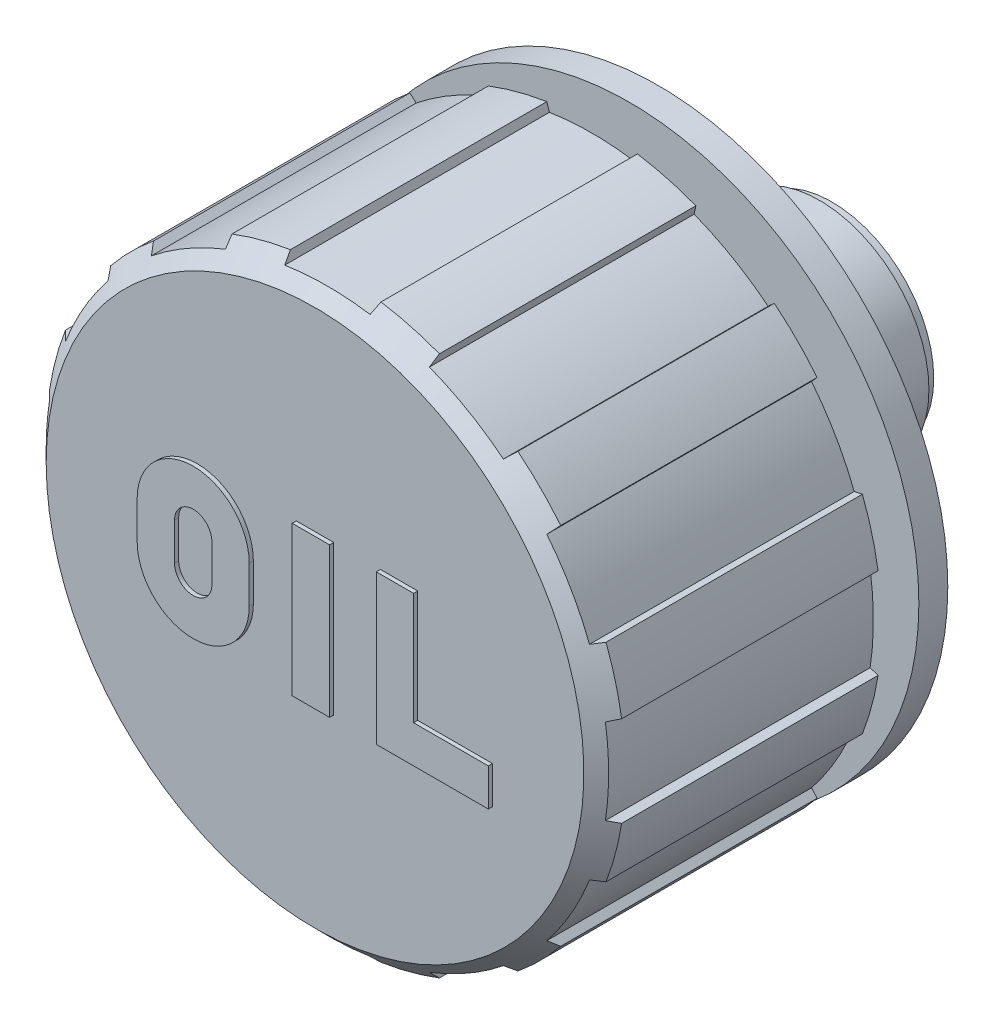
ISO-10303-21;
HEADER;
FILE_DESCRIPTION(('STEP AP214'),'2;1');
FILE_NAME('part.step','',(''),(''),'','','');
FILE_SCHEMA(('AUTOMOTIVE_DESIGN { 1 0 10303 214 1 1 1 1 }'));
ENDSEC;
DATA;
#1=APPLICATION_CONTEXT('core data for automotive mechanical design processes');
#2=APPLICATION_PROTOCOL_DEFINITION('international standard','automotive_design',2000,#1);
#3=PRODUCT_CONTEXT('',#1,'mechanical');
#4=PRODUCT('Part','Part','',(#3));
#5=PRODUCT_RELATED_PRODUCT_CATEGORY('part','',(#4));
#6=PRODUCT_DEFINITION_FORMATION('','',#4);
#7=PRODUCT_DEFINITION_CONTEXT('part definition',#1,'design');
#8=PRODUCT_DEFINITION('design','',#6,#7);
#9=PRODUCT_DEFINITION_SHAPE('','',#8);
#10=(LENGTH_UNIT() NAMED_UNIT(*) SI_UNIT(.MILLI.,.METRE.));
#11=(NAMED_UNIT(*) PLANE_ANGLE_UNIT() SI_UNIT($,.RADIAN.));
#12=(NAMED_UNIT(*) SI_UNIT($,.STERADIAN.) SOLID_ANGLE_UNIT());
#13=UNCERTAINTY_MEASURE_WITH_UNIT(LENGTH_MEASURE(1.E-05),#10,'distance_accuracy_value','');
#14=(GEOMETRIC_REPRESENTATION_CONTEXT(3) GLOBAL_UNCERTAINTY_ASSIGNED_CONTEXT((#13)) GLOBAL_UNIT_ASSIGNED_CONTEXT((#10,
#11,#12)) REPRESENTATION_CONTEXT('',''));
#15=CARTESIAN_POINT('',(0.,0.,0.));
#16=DIRECTION('',(0.,0.,1.));
#17=DIRECTION('',(1.,0.,0.));
#18=AXIS2_PLACEMENT_3D('',#15,#16,#17);
#19=CARTESIAN_POINT('',(-33.6058248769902,5.16222184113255,50.));
#20=DIRECTION('',(0.309016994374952,0.951056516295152,0.));
#21=DIRECTION('',(-0.951056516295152,0.309016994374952,0.));
#22=AXIS2_PLACEMENT_3D('',#19,#20,#21);
#23=PLANE('',#22);
#24=DIRECTION('',(0.,0.,1.));
#25=VECTOR('',#24,1.);
#26=CARTESIAN_POINT('',(-34.5690919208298,5.47520627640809,50.));
#27=LINE('',#26,#25);
#28=CARTESIAN_POINT('',(-34.5690919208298,5.47520627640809,16.));
#29=VERTEX_POINT('',#28);
#30=CARTESIAN_POINT('',(-34.5690919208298,5.47520627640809,47.));
#31=VERTEX_POINT('',#30);
#32=EDGE_CURVE('E456',#29,#31,#27,.T.);
#33=ORIENTED_EDGE('',*,*,#32,.F.);
#34=DIRECTION('',(-0.951056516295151,0.309016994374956,0.));
#35=VECTOR('',#34,1.);
#36=CARTESIAN_POINT('',(-33.6058248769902,5.16222184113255,16.));
#37=LINE('',#36,#35);
#38=CARTESIAN_POINT('',(-33.6058248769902,5.16222184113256,16.));
#39=VERTEX_POINT('',#38);
#40=EDGE_CURVE('E839',#39,#29,#37,.T.);
#41=ORIENTED_EDGE('',*,*,#40,.F.);
#42=DIRECTION('',(0.,0.,1.));
#43=VECTOR('',#42,1.);
#44=CARTESIAN_POINT('',(-33.6058248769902,5.16222184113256,50.));
#45=LINE('',#44,#43);
#46=CARTESIAN_POINT('',(-33.6058248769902,5.16222184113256,48.));
#47=VERTEX_POINT('',#46);
#48=EDGE_CURVE('E452',#47,#39,#45,.F.);
#49=ORIENTED_EDGE('',*,*,#48,.F.);
#50=CARTESIAN_POINT('',(-34.5690919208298,5.47520627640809,47.));
#51=CARTESIAN_POINT('',(-34.4085770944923,5.42305184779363,47.1666982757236));
#52=CARTESIAN_POINT('',(-34.2480474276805,5.37089259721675,47.3333807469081));
#53=CARTESIAN_POINT('',(-33.9269584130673,5.26656445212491,47.6667140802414));
#54=CARTESIAN_POINT('',(-33.7663990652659,5.21439555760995,47.8333649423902));
#55=CARTESIAN_POINT('',(-33.6058248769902,5.16222184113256,48.));
#56=B_SPLINE_CURVE_WITH_KNOTS('',3,(#50,#51,#52,#53,#54,#55),.UNSPECIFIED.,.F.,.F.,(4,2,4),(0.,
0.711660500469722,1.42332100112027),.UNSPECIFIED.);
#57=EDGE_CURVE('E716',#31,#47,#56,.T.);
#58=ORIENTED_EDGE('',*,*,#57,.F.);
#59=EDGE_LOOP('',(#33,#41,#49,#58));
#60=FACE_BOUND('',#59,.T.);
#61=ADVANCED_FACE('F14',(#60),#23,.F.);
#62=CARTESIAN_POINT('',(6.11066752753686E-13,-1.04805053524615E-13,50.));
#63=DIRECTION('',(0.,0.,1.));
#64=DIRECTION('',(1.,0.,0.));
#65=AXIS2_PLACEMENT_3D('',#62,#63,#64);
#66=CYLINDRICAL_SURFACE('',#65,35.0000000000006);
#67=CARTESIAN_POINT('',(6.11066752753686E-13,-1.04805053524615E-13,16.));
#68=DIRECTION('',(0.,0.,1.));
#69=DIRECTION('',(1.,0.,0.));
#70=AXIS2_PLACEMENT_3D('',#67,#68,#69);
#71=CIRCLE('',#70,35.0000000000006);
#72=CARTESIAN_POINT('',(-32.6753149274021,12.5428782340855,16.));
#73=VERTEX_POINT('',#72);
#74=EDGE_CURVE('E453',#73,#29,#71,.T.);
#75=ORIENTED_EDGE('',*,*,#74,.T.);
#76=ORIENTED_EDGE('',*,*,#32,.T.);
#77=CARTESIAN_POINT('',(0.,0.,47.));
#78=DIRECTION('',(0.,0.,-1.));
#79=DIRECTION('',(0.,1.,0.));
#80=AXIS2_PLACEMENT_3D('',#77,#78,#79);
#81=CIRCLE('',#80,35.);
#82=CARTESIAN_POINT('',(-32.6753149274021,12.5428782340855,47.));
#83=VERTEX_POINT('',#82);
#84=EDGE_CURVE('E927',#83,#31,#81,.F.);
#85=ORIENTED_EDGE('',*,*,#84,.F.);
#86=DIRECTION('',(0.,0.,1.));
#87=VECTOR('',#86,1.);
#88=CARTESIAN_POINT('',(-32.6753149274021,12.5428782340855,50.));
#89=LINE('',#88,#87);
#90=EDGE_CURVE('E457',#83,#73,#89,.F.);
#91=ORIENTED_EDGE('',*,*,#90,.T.);
#92=EDGE_LOOP('',(#75,#76,#85,#91));
#93=FACE_BOUND('',#92,.T.);
#94=ADVANCED_FACE('F1513',(#93),#66,.T.);
#95=CARTESIAN_POINT('',(-32.6753149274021,12.5428782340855,50.));
#96=DIRECTION('',(-0.207911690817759,-0.978147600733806,0.));
#97=DIRECTION('',(0.978147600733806,-0.207911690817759,0.));
#98=AXIS2_PLACEMENT_3D('',#95,#96,#97);
#99=PLANE('',#98);
#100=DIRECTION('',(0.,0.,1.));
#101=VECTOR('',#100,1.);
#102=CARTESIAN_POINT('',(-31.6846089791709,12.3322971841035,50.));
#103=LINE('',#102,#101);
#104=CARTESIAN_POINT('',(-31.6846089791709,12.3322971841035,16.));
#105=VERTEX_POINT('',#104);
#106=CARTESIAN_POINT('',(-31.6846089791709,12.3322971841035,48.));
#107=VERTEX_POINT('',#106);
#108=EDGE_CURVE('E461',#105,#107,#103,.T.);
#109=ORIENTED_EDGE('',*,*,#108,.F.);
#110=DIRECTION('',(0.978147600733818,-0.207911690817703,0.));
#111=VECTOR('',#110,1.);
#112=CARTESIAN_POINT('',(-32.6753149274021,12.5428782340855,16.));
#113=LINE('',#112,#111);
#114=EDGE_CURVE('E882',#73,#105,#113,.T.);
#115=ORIENTED_EDGE('',*,*,#114,.F.);
#116=ORIENTED_EDGE('',*,*,#90,.F.);
#117=CARTESIAN_POINT('',(-31.6846089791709,12.3322971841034,48.));
#118=CARTESIAN_POINT('',(-31.8497571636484,12.367400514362,47.8333649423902));
#119=CARTESIAN_POINT('',(-32.0148900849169,12.4025006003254,47.6667140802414));
#120=CARTESIAN_POINT('',(-32.345125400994,12.4726942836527,47.3333807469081));
#121=CARTESIAN_POINT('',(-32.5102277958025,12.5077878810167,47.1666982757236));
#122=CARTESIAN_POINT('',(-32.6753149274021,12.5428782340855,47.));
#123=B_SPLINE_CURVE_WITH_KNOTS('',3,(#117,#118,#119,#120,#121,#122),.UNSPECIFIED.,.F.,.F.,(4,2,
4),(0.,0.711660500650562,1.42332100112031),.UNSPECIFIED.);
#124=EDGE_CURVE('E724',#107,#83,#123,.T.);
#125=ORIENTED_EDGE('',*,*,#124,.F.);
#126=EDGE_LOOP('',(#109,#115,#116,#125));
#127=FACE_BOUND('',#126,.T.);
#128=ADVANCED_FACE('F1834',(#127),#99,.F.);
#129=CARTESIAN_POINT('',(2.1316282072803E-13,-1.91846538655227E-13,50.));
#130=DIRECTION('',(0.,0.,1.));
#131=DIRECTION('',(1.,0.,0.));
#132=AXIS2_PLACEMENT_3D('',#129,#130,#131);
#133=CYLINDRICAL_SURFACE('',#132,34.);
#134=CARTESIAN_POINT('',(2.1316282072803E-13,-1.91846538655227E-13,16.));
#135=DIRECTION('',(0.,0.,1.));
#136=DIRECTION('',(1.,0.,0.));
#137=AXIS2_PLACEMENT_3D('',#134,#135,#136);
#138=CIRCLE('',#137,34.);
#139=CARTESIAN_POINT('',(-26.5223871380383,21.2735276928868,16.));
#140=VERTEX_POINT('',#139);
#141=EDGE_CURVE('E458',#140,#105,#138,.T.);
#142=ORIENTED_EDGE('',*,*,#141,.T.);
#143=ORIENTED_EDGE('',*,*,#108,.T.);
#144=CARTESIAN_POINT('',(0.,0.,48.));
#145=DIRECTION('',(0.,0.,-1.));
#146=DIRECTION('',(0.,1.,0.));
#147=AXIS2_PLACEMENT_3D('',#144,#145,#146);
#148=CIRCLE('',#147,34.);
#149=CARTESIAN_POINT('',(-26.5223871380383,21.2735276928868,48.));
#150=VERTEX_POINT('',#149);
#151=EDGE_CURVE('E934',#150,#107,#148,.F.);
#152=ORIENTED_EDGE('',*,*,#151,.F.);
#153=DIRECTION('',(0.,0.,1.));
#154=VECTOR('',#153,1.);
#155=CARTESIAN_POINT('',(-26.5223871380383,21.2735276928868,50.));
#156=LINE('',#155,#154);
#157=EDGE_CURVE('E462',#150,#140,#156,.F.);
#158=ORIENTED_EDGE('',*,*,#157,.T.);
#159=EDGE_LOOP('',(#142,#143,#152,#158));
#160=FACE_BOUND('',#159,.T.);
#161=ADVANCED_FACE('F1826',(#160),#133,.T.);
#162=CARTESIAN_POINT('',(-26.5223871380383,21.2735276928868,50.));
#163=DIRECTION('',(0.743144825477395,0.669130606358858,0.));
#164=DIRECTION('',(-0.669130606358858,0.743144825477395,0.));
#165=AXIS2_PLACEMENT_3D('',#162,#163,#164);
#166=PLANE('',#165);
#167=DIRECTION('',(0.,0.,1.));
#168=VECTOR('',#167,1.);
#169=CARTESIAN_POINT('',(-27.200108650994,22.0262136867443,50.));
#170=LINE('',#169,#168);
#171=CARTESIAN_POINT('',(-27.200108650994,22.0262136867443,16.));
#172=VERTEX_POINT('',#171);
#173=CARTESIAN_POINT('',(-27.200108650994,22.0262136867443,47.));
#174=VERTEX_POINT('',#173);
#175=EDGE_CURVE('E466',#172,#174,#170,.T.);
#176=ORIENTED_EDGE('',*,*,#175,.F.);
#177=DIRECTION('',(-0.669130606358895,0.743144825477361,0.));
#178=VECTOR('',#177,1.);
#179=CARTESIAN_POINT('',(-26.5223871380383,21.2735276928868,16.));
#180=LINE('',#179,#178);
#181=EDGE_CURVE('E880',#140,#172,#180,.T.);
#182=ORIENTED_EDGE('',*,*,#181,.F.);
#183=ORIENTED_EDGE('',*,*,#157,.F.);
#184=CARTESIAN_POINT('',(-27.200108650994,22.0262136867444,47.));
#185=CARTESIAN_POINT('',(-27.0871759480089,21.9007892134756,47.1666982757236));
#186=CARTESIAN_POINT('',(-26.9742328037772,21.7753531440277,47.3333807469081));
#187=CARTESIAN_POINT('',(-26.748325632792,21.5244578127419,47.6667140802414));
#188=CARTESIAN_POINT('',(-26.6353616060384,21.3989985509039,47.8333649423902));
#189=CARTESIAN_POINT('',(-26.5223871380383,21.2735276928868,48.));
#190=B_SPLINE_CURVE_WITH_KNOTS('',3,(#184,#185,#186,#187,#188,#189),.UNSPECIFIED.,.F.,.F.,(4,2,
4),(0.,0.711660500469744,1.42332100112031),.UNSPECIFIED.);
#191=EDGE_CURVE('E731',#174,#150,#190,.T.);
#192=ORIENTED_EDGE('',*,*,#191,.F.);
#193=EDGE_LOOP('',(#176,#182,#183,#192));
#194=FACE_BOUND('',#193,.T.);
#195=ADVANCED_FACE('F750',(#194),#166,.F.);
#196=CARTESIAN_POINT('',(1.52766688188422E-13,-3.12638803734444E-13,50.));
#197=DIRECTION('',(0.,0.,1.));
#198=DIRECTION('',(1.,0.,0.));
#199=AXIS2_PLACEMENT_3D('',#196,#197,#198);
#200=CYLINDRICAL_SURFACE('',#199,35.);
#201=CARTESIAN_POINT('',(1.52766688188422E-13,-3.12638803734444E-13,16.));
#202=DIRECTION('',(0.,0.,1.));
#203=DIRECTION('',(1.,0.,0.));
#204=AXIS2_PLACEMENT_3D('',#201,#202,#203);
#205=CIRCLE('',#204,35.);
#206=CARTESIAN_POINT('',(-22.0262136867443,27.200108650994,16.));
#207=VERTEX_POINT('',#206);
#208=EDGE_CURVE('E463',#207,#172,#205,.T.);
#209=ORIENTED_EDGE('',*,*,#208,.T.);
#210=ORIENTED_EDGE('',*,*,#175,.T.);
#211=CARTESIAN_POINT('',(0.,0.,47.));
#212=DIRECTION('',(0.,0.,-1.));
#213=DIRECTION('',(0.,1.,0.));
#214=AXIS2_PLACEMENT_3D('',#211,#212,#213);
#215=CIRCLE('',#214,35.);
#216=CARTESIAN_POINT('',(-22.0262136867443,27.200108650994,47.));
#217=VERTEX_POINT('',#216);
#218=EDGE_CURVE('E941',#217,#174,#215,.F.);
#219=ORIENTED_EDGE('',*,*,#218,.F.);
#220=DIRECTION('',(0.,0.,1.));
#221=VECTOR('',#220,1.);
#222=CARTESIAN_POINT('',(-22.0262136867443,27.200108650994,50.));
#223=LINE('',#222,#221);
#224=EDGE_CURVE('E467',#217,#207,#223,.F.);
#225=ORIENTED_EDGE('',*,*,#224,.T.);
#226=EDGE_LOOP('',(#209,#210,#219,#225));
#227=FACE_BOUND('',#226,.T.);
#228=ADVANCED_FACE('F747',(#227),#200,.T.);
#229=CARTESIAN_POINT('',(-22.0262136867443,27.200108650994,50.));
#230=DIRECTION('',(-0.669130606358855,-0.743144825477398,0.));
#231=DIRECTION('',(0.743144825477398,-0.669130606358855,0.));
#232=AXIS2_PLACEMENT_3D('',#229,#230,#231);
#233=PLANE('',#232);
#234=DIRECTION('',(0.,0.,1.));
#235=VECTOR('',#234,1.);
#236=CARTESIAN_POINT('',(-21.2735276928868,26.5223871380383,50.));
#237=LINE('',#236,#235);
#238=CARTESIAN_POINT('',(-21.2735276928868,26.5223871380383,16.));
#239=VERTEX_POINT('',#238);
#240=CARTESIAN_POINT('',(-21.2735276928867,26.5223871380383,48.));
#241=VERTEX_POINT('',#240);
#242=EDGE_CURVE('E471',#239,#241,#237,.T.);
#243=ORIENTED_EDGE('',*,*,#242,.F.);
#244=DIRECTION('',(0.743144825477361,-0.669130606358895,0.));
#245=VECTOR('',#244,1.);
#246=CARTESIAN_POINT('',(-22.0262136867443,27.200108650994,16.));
#247=LINE('',#246,#245);
#248=EDGE_CURVE('E878',#207,#239,#247,.T.);
#249=ORIENTED_EDGE('',*,*,#248,.F.);
#250=ORIENTED_EDGE('',*,*,#224,.F.);
#251=CARTESIAN_POINT('',(-21.2735276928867,26.5223871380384,48.));
#252=CARTESIAN_POINT('',(-21.3989985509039,26.6353616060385,47.8333649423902));
#253=CARTESIAN_POINT('',(-21.5244578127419,26.748325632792,47.6667140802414));
#254=CARTESIAN_POINT('',(-21.7753531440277,26.9742328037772,47.3333807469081));
#255=CARTESIAN_POINT('',(-21.9007892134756,27.0871759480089,47.1666982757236));
#256=CARTESIAN_POINT('',(-22.0262136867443,27.200108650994,47.));
#257=B_SPLINE_CURVE_WITH_KNOTS('',3,(#251,#252,#253,#254,#255,#256),.UNSPECIFIED.,.F.,.F.,(4,2,
4),(0.,0.71166050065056,1.42332100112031),.UNSPECIFIED.);
#258=EDGE_CURVE('E737',#241,#217,#257,.T.);
#259=ORIENTED_EDGE('',*,*,#258,.F.);
#260=EDGE_LOOP('',(#243,#249,#250,#259));
#261=FACE_BOUND('',#260,.T.);
#262=ADVANCED_FACE('F743',(#261),#233,.F.);
#263=CARTESIAN_POINT('',(0.,-1.4210854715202E-13,50.));
#264=DIRECTION('',(0.,0.,1.));
#265=DIRECTION('',(1.,0.,0.));
#266=AXIS2_PLACEMENT_3D('',#263,#264,#265);
#267=CYLINDRICAL_SURFACE('',#266,34.);
#268=CARTESIAN_POINT('',(0.,-1.4210854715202E-13,16.));
#269=DIRECTION('',(0.,0.,1.));
#270=DIRECTION('',(1.,0.,0.));
#271=AXIS2_PLACEMENT_3D('',#268,#269,#270);
#272=CIRCLE('',#271,34.);
#273=CARTESIAN_POINT('',(-12.3322971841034,31.6846089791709,16.));
#274=VERTEX_POINT('',#273);
#275=EDGE_CURVE('E468',#274,#239,#272,.T.);
#276=ORIENTED_EDGE('',*,*,#275,.T.);
#277=ORIENTED_EDGE('',*,*,#242,.T.);
#278=CARTESIAN_POINT('',(0.,0.,48.));
#279=DIRECTION('',(0.,0.,-1.));
#280=DIRECTION('',(0.,1.,0.));
#281=AXIS2_PLACEMENT_3D('',#278,#279,#280);
#282=CIRCLE('',#281,34.);
#283=CARTESIAN_POINT('',(-12.3322971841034,31.6846089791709,48.));
#284=VERTEX_POINT('',#283);
#285=EDGE_CURVE('E948',#284,#241,#282,.F.);
#286=ORIENTED_EDGE('',*,*,#285,.F.);
#287=DIRECTION('',(0.,0.,1.));
#288=VECTOR('',#287,1.);
#289=CARTESIAN_POINT('',(-12.3322971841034,31.6846089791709,50.));
#290=LINE('',#289,#288);
#291=EDGE_CURVE('E472',#284,#274,#290,.F.);
#292=ORIENTED_EDGE('',*,*,#291,.T.);
#293=EDGE_LOOP('',(#276,#277,#286,#292));
#294=FACE_BOUND('',#293,.T.);
#295=ADVANCED_FACE('F746',(#294),#267,.T.);
#296=CARTESIAN_POINT('',(-12.3322971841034,31.6846089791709,50.));
#297=DIRECTION('',(0.978147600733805,0.207911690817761,0.));
#298=DIRECTION('',(-0.207911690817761,0.978147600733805,0.));
#299=AXIS2_PLACEMENT_3D('',#296,#297,#298);
#300=PLANE('',#299);
#301=DIRECTION('',(0.,0.,1.));
#302=VECTOR('',#301,1.);
#303=CARTESIAN_POINT('',(-12.5428782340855,32.6753149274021,50.));
#304=LINE('',#303,#302);
#305=CARTESIAN_POINT('',(-12.5428782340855,32.6753149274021,16.));
#306=VERTEX_POINT('',#305);
#307=CARTESIAN_POINT('',(-12.5428782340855,32.6753149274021,47.));
#308=VERTEX_POINT('',#307);
#309=EDGE_CURVE('E476',#306,#308,#304,.T.);
#310=ORIENTED_EDGE('',*,*,#309,.F.);
#311=DIRECTION('',(-0.207911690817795,0.978147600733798,0.));
#312=VECTOR('',#311,1.);
#313=CARTESIAN_POINT('',(-12.3322971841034,31.6846089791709,16.));
#314=LINE('',#313,#312);
#315=EDGE_CURVE('E876',#274,#306,#314,.T.);
#316=ORIENTED_EDGE('',*,*,#315,.F.);
#317=ORIENTED_EDGE('',*,*,#291,.F.);
#318=CARTESIAN_POINT('',(-12.5428782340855,32.6753149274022,47.));
#319=CARTESIAN_POINT('',(-12.5077878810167,32.5102277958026,47.1666982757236));
#320=CARTESIAN_POINT('',(-12.4726942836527,32.345125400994,47.3333807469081));
#321=CARTESIAN_POINT('',(-12.4025006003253,32.0148900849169,47.6667140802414));
#322=CARTESIAN_POINT('',(-12.367400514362,31.8497571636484,47.8333649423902));
#323=CARTESIAN_POINT('',(-12.3322971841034,31.6846089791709,48.));
#324=B_SPLINE_CURVE_WITH_KNOTS('',3,(#318,#319,#320,#321,#322,#323),.UNSPECIFIED.,.F.,.F.,(4,2,
4),(0.,0.711660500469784,1.42332100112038),.UNSPECIFIED.);
#325=EDGE_CURVE('E577',#308,#284,#324,.T.);
#326=ORIENTED_EDGE('',*,*,#325,.F.);
#327=EDGE_LOOP('',(#310,#316,#317,#326));
#328=FACE_BOUND('',#327,.T.);
#329=ADVANCED_FACE('F749',(#328),#300,.F.);
#330=CARTESIAN_POINT('',(1.58095758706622E-13,-1.62003743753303E-12,50.));
#331=DIRECTION('',(0.,0.,1.));
#332=DIRECTION('',(1.,0.,0.));
#333=AXIS2_PLACEMENT_3D('',#330,#331,#332);
#334=CYLINDRICAL_SURFACE('',#333,35.0000000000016);
#335=CARTESIAN_POINT('',(1.58095758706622E-13,-1.62003743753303E-12,16.));
#336=DIRECTION('',(0.,0.,1.));
#337=DIRECTION('',(1.,0.,0.));
#338=AXIS2_PLACEMENT_3D('',#335,#336,#337);
#339=CIRCLE('',#338,35.0000000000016);
#340=CARTESIAN_POINT('',(-5.47520627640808,34.5690919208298,16.));
#341=VERTEX_POINT('',#340);
#342=EDGE_CURVE('E473',#341,#306,#339,.T.);
#343=ORIENTED_EDGE('',*,*,#342,.T.);
#344=ORIENTED_EDGE('',*,*,#309,.T.);
#345=CARTESIAN_POINT('',(0.,0.,47.));
#346=DIRECTION('',(0.,0.,-1.));
#347=DIRECTION('',(0.,1.,0.));
#348=AXIS2_PLACEMENT_3D('',#345,#346,#347);
#349=CIRCLE('',#348,35.);
#350=CARTESIAN_POINT('',(-5.47520627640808,34.5690919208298,47.));
#351=VERTEX_POINT('',#350);
#352=EDGE_CURVE('E955',#351,#308,#349,.F.);
#353=ORIENTED_EDGE('',*,*,#352,.F.);
#354=DIRECTION('',(0.,0.,1.));
#355=VECTOR('',#354,1.);
#356=CARTESIAN_POINT('',(-5.47520627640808,34.5690919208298,50.));
#357=LINE('',#356,#355);
#358=EDGE_CURVE('E477',#351,#341,#357,.F.);
#359=ORIENTED_EDGE('',*,*,#358,.T.);
#360=EDGE_LOOP('',(#343,#344,#353,#359));
#361=FACE_BOUND('',#360,.T.);
#362=ADVANCED_FACE('F755',(#361),#334,.T.);
#363=CARTESIAN_POINT('',(-5.47520627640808,34.5690919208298,50.));
#364=DIRECTION('',(-0.951056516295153,-0.309016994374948,0.));
#365=DIRECTION('',(0.309016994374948,-0.951056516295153,0.));
#366=AXIS2_PLACEMENT_3D('',#363,#364,#365);
#367=PLANE('',#366);
#368=DIRECTION('',(0.,0.,1.));
#369=VECTOR('',#368,1.);
#370=CARTESIAN_POINT('',(-5.16222184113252,33.6058248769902,50.));
#371=LINE('',#370,#369);
#372=CARTESIAN_POINT('',(-5.16222184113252,33.6058248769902,16.));
#373=VERTEX_POINT('',#372);
#374=CARTESIAN_POINT('',(-5.16222184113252,33.6058248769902,48.));
#375=VERTEX_POINT('',#374);
#376=EDGE_CURVE('E481',#373,#375,#371,.T.);
#377=ORIENTED_EDGE('',*,*,#376,.F.);
#378=DIRECTION('',(0.309016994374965,-0.951056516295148,0.));
#379=VECTOR('',#378,1.);
#380=CARTESIAN_POINT('',(-5.47520627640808,34.5690919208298,16.));
#381=LINE('',#380,#379);
#382=EDGE_CURVE('E874',#341,#373,#381,.T.);
#383=ORIENTED_EDGE('',*,*,#382,.F.);
#384=ORIENTED_EDGE('',*,*,#358,.F.);
#385=CARTESIAN_POINT('',(-5.16222184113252,33.6058248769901,48.));
#386=CARTESIAN_POINT('',(-5.21439555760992,33.7663990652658,47.8333649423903));
#387=CARTESIAN_POINT('',(-5.26656445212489,33.9269584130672,47.6667140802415));
#388=CARTESIAN_POINT('',(-5.37089259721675,34.2480474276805,47.3333807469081));
#389=CARTESIAN_POINT('',(-5.42305184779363,34.4085770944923,47.1666982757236));
#390=CARTESIAN_POINT('',(-5.47520627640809,34.5690919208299,47.));
#391=B_SPLINE_CURVE_WITH_KNOTS('',3,(#385,#386,#387,#388,#389,#390),.UNSPECIFIED.,.F.,.F.,(4,2,
4),(0.,0.711660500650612,1.42332100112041),.UNSPECIFIED.);
#392=EDGE_CURVE('E764',#375,#351,#391,.T.);
#393=ORIENTED_EDGE('',*,*,#392,.F.);
#394=EDGE_LOOP('',(#377,#383,#384,#393));
#395=FACE_BOUND('',#394,.T.);
#396=ADVANCED_FACE('F757',(#395),#367,.F.);
#397=CARTESIAN_POINT('',(1.54543045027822E-13,2.34479102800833E-13,50.));
#398=DIRECTION('',(0.,0.,1.));
#399=DIRECTION('',(1.,0.,0.));
#400=AXIS2_PLACEMENT_3D('',#397,#398,#399);
#401=CYLINDRICAL_SURFACE('',#400,34.);
#402=ORIENTED_EDGE('',*,*,#376,.T.);
#403=CARTESIAN_POINT('',(0.,0.,48.));
#404=DIRECTION('',(0.,0.,-1.));
#405=DIRECTION('',(0.,1.,0.));
#406=AXIS2_PLACEMENT_3D('',#403,#404,#405);
#407=CIRCLE('',#406,34.);
#408=CARTESIAN_POINT('',(5.16222184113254,33.6058248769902,48.));
#409=VERTEX_POINT('',#408);
#410=EDGE_CURVE('E961',#409,#375,#407,.F.);
#411=ORIENTED_EDGE('',*,*,#410,.F.);
#412=DIRECTION('',(0.,0.,1.));
#413=VECTOR('',#412,1.);
#414=CARTESIAN_POINT('',(5.16222184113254,33.6058248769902,50.));
#415=LINE('',#414,#413);
#416=CARTESIAN_POINT('',(5.16222184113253,33.6058248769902,16.));
#417=VERTEX_POINT('',#416);
#418=EDGE_CURVE('E482',#409,#417,#415,.F.);
#419=ORIENTED_EDGE('',*,*,#418,.T.);
#420=CARTESIAN_POINT('',(1.54543045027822E-13,2.34479102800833E-13,16.));
#421=DIRECTION('',(0.,0.,1.));
#422=DIRECTION('',(1.,0.,0.));
#423=AXIS2_PLACEMENT_3D('',#420,#421,#422);
#424=CIRCLE('',#423,34.);
#425=EDGE_CURVE('E478',#417,#373,#424,.T.);
#426=ORIENTED_EDGE('',*,*,#425,.T.);
#427=EDGE_LOOP('',(#402,#411,#419,#426));
#428=FACE_BOUND('',#427,.T.);
#429=ADVANCED_FACE('F760',(#428),#401,.T.);
#430=CARTESIAN_POINT('',(5.16222184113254,33.6058248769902,50.));
#431=DIRECTION('',(0.951056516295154,-0.309016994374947,0.));
#432=DIRECTION('',(0.309016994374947,0.951056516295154,0.));
#433=AXIS2_PLACEMENT_3D('',#430,#431,#432);
#434=PLANE('',#433);
#435=DIRECTION('',(0.,0.,1.));
#436=VECTOR('',#435,1.);
#437=CARTESIAN_POINT('',(5.47520627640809,34.5690919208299,50.));
#438=LINE('',#437,#436);
#439=CARTESIAN_POINT('',(5.47520627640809,34.5690919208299,16.));
#440=VERTEX_POINT('',#439);
#441=CARTESIAN_POINT('',(5.47520627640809,34.5690919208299,47.));
#442=VERTEX_POINT('',#441);
#443=EDGE_CURVE('E486',#440,#442,#438,.T.);
#444=ORIENTED_EDGE('',*,*,#443,.F.);
#445=DIRECTION('',(0.309016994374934,0.951056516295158,0.));
#446=VECTOR('',#445,1.);
#447=CARTESIAN_POINT('',(5.16222184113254,33.6058248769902,16.));
#448=LINE('',#447,#446);
#449=EDGE_CURVE('E872',#417,#440,#448,.T.);
#450=ORIENTED_EDGE('',*,*,#449,.F.);
#451=ORIENTED_EDGE('',*,*,#418,.F.);
#452=CARTESIAN_POINT('',(5.47520627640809,34.5690919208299,47.));
#453=CARTESIAN_POINT('',(5.42305184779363,34.4085770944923,47.1666982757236));
#454=CARTESIAN_POINT('',(5.37089259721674,34.2480474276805,47.3333807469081));
#455=CARTESIAN_POINT('',(5.2665644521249,33.9269584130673,47.6667140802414));
#456=CARTESIAN_POINT('',(5.21439555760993,33.7663990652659,47.8333649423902));
#457=CARTESIAN_POINT('',(5.16222184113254,33.6058248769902,48.));
#458=B_SPLINE_CURVE_WITH_KNOTS('',3,(#452,#453,#454,#455,#456,#457),.UNSPECIFIED.,.F.,.F.,(4,2,
4),(0.,0.711660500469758,1.42332100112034),.UNSPECIFIED.);
#459=EDGE_CURVE('E589',#442,#409,#458,.T.);
#460=ORIENTED_EDGE('',*,*,#459,.F.);
#461=EDGE_LOOP('',(#444,#450,#451,#460));
#462=FACE_BOUND('',#461,.T.);
#463=ADVANCED_FACE('F762',(#462),#434,.F.);
#464=CARTESIAN_POINT('',(-5.04485342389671E-13,-1.04449782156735E-12,50.));
#465=DIRECTION('',(0.,0.,1.));
#466=DIRECTION('',(1.,0.,0.));
#467=AXIS2_PLACEMENT_3D('',#464,#465,#466);
#468=CYLINDRICAL_SURFACE('',#467,35.0000000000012);
#469=CARTESIAN_POINT('',(-5.04485342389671E-13,-1.04449782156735E-12,16.));
#470=DIRECTION('',(0.,0.,1.));
#471=DIRECTION('',(1.,0.,0.));
#472=AXIS2_PLACEMENT_3D('',#469,#470,#471);
#473=CIRCLE('',#472,35.0000000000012);
#474=CARTESIAN_POINT('',(12.5428782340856,32.6753149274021,16.));
#475=VERTEX_POINT('',#474);
#476=EDGE_CURVE('E483',#475,#440,#473,.T.);
#477=ORIENTED_EDGE('',*,*,#476,.T.);
#478=ORIENTED_EDGE('',*,*,#443,.T.);
#479=CARTESIAN_POINT('',(0.,0.,47.));
#480=DIRECTION('',(0.,0.,-1.));
#481=DIRECTION('',(0.,1.,0.));
#482=AXIS2_PLACEMENT_3D('',#479,#480,#481);
#483=CIRCLE('',#482,35.);
#484=CARTESIAN_POINT('',(12.5428782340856,32.6753149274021,47.));
#485=VERTEX_POINT('',#484);
#486=EDGE_CURVE('E968',#485,#442,#483,.F.);
#487=ORIENTED_EDGE('',*,*,#486,.F.);
#488=DIRECTION('',(0.,0.,1.));
#489=VECTOR('',#488,1.);
#490=CARTESIAN_POINT('',(12.5428782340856,32.6753149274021,50.));
#491=LINE('',#490,#489);
#492=EDGE_CURVE('E487',#485,#475,#491,.F.);
#493=ORIENTED_EDGE('',*,*,#492,.T.);
#494=EDGE_LOOP('',(#477,#478,#487,#493));
#495=FACE_BOUND('',#494,.T.);
#496=ADVANCED_FACE('F1073',(#495),#468,.T.);
#497=CARTESIAN_POINT('',(12.5428782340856,32.675314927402,50.));
#498=DIRECTION('',(-0.978147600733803,0.207911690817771,0.));
#499=DIRECTION('',(-0.207911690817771,-0.978147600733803,0.));
#500=AXIS2_PLACEMENT_3D('',#497,#498,#499);
#501=PLANE('',#500);
#502=DIRECTION('',(0.,0.,1.));
#503=VECTOR('',#502,1.);
#504=CARTESIAN_POINT('',(12.3322971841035,31.6846089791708,50.));
#505=LINE('',#504,#503);
#506=CARTESIAN_POINT('',(12.3322971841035,31.6846089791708,16.));
#507=VERTEX_POINT('',#506);
#508=CARTESIAN_POINT('',(12.3322971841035,31.6846089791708,48.));
#509=VERTEX_POINT('',#508);
#510=EDGE_CURVE('E491',#507,#509,#505,.T.);
#511=ORIENTED_EDGE('',*,*,#510,.F.);
#512=DIRECTION('',(-0.207911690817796,-0.978147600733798,0.));
#513=VECTOR('',#512,1.);
#514=CARTESIAN_POINT('',(12.5428782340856,32.675314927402,16.));
#515=LINE('',#514,#513);
#516=EDGE_CURVE('E870',#475,#507,#515,.T.);
#517=ORIENTED_EDGE('',*,*,#516,.F.);
#518=ORIENTED_EDGE('',*,*,#492,.F.);
#519=CARTESIAN_POINT('',(12.3322971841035,31.6846089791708,48.));
#520=CARTESIAN_POINT('',(12.3674005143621,31.8497571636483,47.8333649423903));
#521=CARTESIAN_POINT('',(12.4025006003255,32.0148900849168,47.6667140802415));
#522=CARTESIAN_POINT('',(12.4726942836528,32.3451254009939,47.3333807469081));
#523=CARTESIAN_POINT('',(12.5077878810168,32.5102277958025,47.1666982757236));
#524=CARTESIAN_POINT('',(12.5428782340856,32.6753149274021,47.));
#525=B_SPLINE_CURVE_WITH_KNOTS('',3,(#519,#520,#521,#522,#523,#524),.UNSPECIFIED.,.F.,.F.,(4,2,
4),(0.,0.711660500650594,1.42332100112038),.UNSPECIFIED.);
#526=EDGE_CURVE('E597',#509,#485,#525,.T.);
#527=ORIENTED_EDGE('',*,*,#526,.F.);
#528=EDGE_LOOP('',(#511,#517,#518,#527));
#529=FACE_BOUND('',#528,.T.);
#530=ADVANCED_FACE('F1069',(#529),#501,.F.);
#531=CARTESIAN_POINT('',(4.72510919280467E-13,4.72510919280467E-13,50.));
#532=DIRECTION('',(0.,0.,1.));
#533=DIRECTION('',(1.,0.,0.));
#534=AXIS2_PLACEMENT_3D('',#531,#532,#533);
#535=CYLINDRICAL_SURFACE('',#534,33.9999999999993);
#536=CARTESIAN_POINT('',(4.72510919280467E-13,4.72510919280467E-13,16.));
#537=DIRECTION('',(0.,0.,1.));
#538=DIRECTION('',(1.,0.,0.));
#539=AXIS2_PLACEMENT_3D('',#536,#537,#538);
#540=CIRCLE('',#539,33.9999999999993);
#541=CARTESIAN_POINT('',(21.2735276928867,26.5223871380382,16.));
#542=VERTEX_POINT('',#541);
#543=EDGE_CURVE('E488',#542,#507,#540,.T.);
#544=ORIENTED_EDGE('',*,*,#543,.T.);
#545=ORIENTED_EDGE('',*,*,#510,.T.);
#546=CARTESIAN_POINT('',(0.,0.,48.));
#547=DIRECTION('',(0.,0.,-1.));
#548=DIRECTION('',(0.,1.,0.));
#549=AXIS2_PLACEMENT_3D('',#546,#547,#548);
#550=CIRCLE('',#549,34.);
#551=CARTESIAN_POINT('',(21.2735276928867,26.5223871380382,48.));
#552=VERTEX_POINT('',#551);
#553=EDGE_CURVE('E970',#552,#509,#550,.F.);
#554=ORIENTED_EDGE('',*,*,#553,.F.);
#555=DIRECTION('',(0.,0.,1.));
#556=VECTOR('',#555,1.);
#557=CARTESIAN_POINT('',(21.2735276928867,26.5223871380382,50.));
#558=LINE('',#557,#556);
#559=EDGE_CURVE('E492',#552,#542,#558,.F.);
#560=ORIENTED_EDGE('',*,*,#559,.T.);
#561=EDGE_LOOP('',(#544,#545,#554,#560));
#562=FACE_BOUND('',#561,.T.);
#563=ADVANCED_FACE('F1066',(#562),#535,.T.);
#564=CARTESIAN_POINT('',(21.2735276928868,26.5223871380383,50.));
#565=DIRECTION('',(0.669130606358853,-0.743144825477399,0.));
#566=DIRECTION('',(0.743144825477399,0.669130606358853,0.));
#567=AXIS2_PLACEMENT_3D('',#564,#565,#566);
#568=PLANE('',#567);
#569=DIRECTION('',(0.,0.,1.));
#570=VECTOR('',#569,1.);
#571=CARTESIAN_POINT('',(22.0262136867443,27.2001086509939,50.));
#572=LINE('',#571,#570);
#573=CARTESIAN_POINT('',(22.0262136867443,27.2001086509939,16.));
#574=VERTEX_POINT('',#573);
#575=CARTESIAN_POINT('',(22.0262136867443,27.200108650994,47.));
#576=VERTEX_POINT('',#575);
#577=EDGE_CURVE('E496',#574,#576,#572,.T.);
#578=ORIENTED_EDGE('',*,*,#577,.F.);
#579=DIRECTION('',(0.743144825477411,0.66913060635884,0.));
#580=VECTOR('',#579,1.);
#581=CARTESIAN_POINT('',(21.2735276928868,26.5223871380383,16.));
#582=LINE('',#581,#580);
#583=EDGE_CURVE('E868',#542,#574,#582,.T.);
#584=ORIENTED_EDGE('',*,*,#583,.F.);
#585=ORIENTED_EDGE('',*,*,#559,.F.);
#586=CARTESIAN_POINT('',(22.0262136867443,27.200108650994,47.));
#587=CARTESIAN_POINT('',(21.9007892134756,27.0871759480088,47.1666982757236));
#588=CARTESIAN_POINT('',(21.7753531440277,26.9742328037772,47.3333807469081));
#589=CARTESIAN_POINT('',(21.5244578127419,26.748325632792,47.6667140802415));
#590=CARTESIAN_POINT('',(21.3989985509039,26.6353616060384,47.8333649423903));
#591=CARTESIAN_POINT('',(21.2735276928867,26.5223871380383,48.));
#592=B_SPLINE_CURVE_WITH_KNOTS('',3,(#586,#587,#588,#589,#590,#591),.UNSPECIFIED.,.F.,.F.,(4,2,
4),(0.,0.711660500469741,1.4233210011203),.UNSPECIFIED.);
#593=EDGE_CURVE('E605',#576,#552,#592,.T.);
#594=ORIENTED_EDGE('',*,*,#593,.F.);
#595=EDGE_LOOP('',(#578,#584,#585,#594));
#596=FACE_BOUND('',#595,.T.);
#597=ADVANCED_FACE('F1062',(#596),#568,.F.);
#598=CARTESIAN_POINT('',(6.60804744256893E-13,5.61328761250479E-13,50.));
#599=DIRECTION('',(0.,0.,1.));
#600=DIRECTION('',(1.,0.,0.));
#601=AXIS2_PLACEMENT_3D('',#598,#599,#600);
#602=CYLINDRICAL_SURFACE('',#601,34.9999999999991);
#603=CARTESIAN_POINT('',(6.60804744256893E-13,5.61328761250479E-13,16.));
#604=DIRECTION('',(0.,0.,1.));
#605=DIRECTION('',(1.,0.,0.));
#606=AXIS2_PLACEMENT_3D('',#603,#604,#605);
#607=CIRCLE('',#606,34.9999999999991);
#608=CARTESIAN_POINT('',(27.200108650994,22.0262136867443,16.));
#609=VERTEX_POINT('',#608);
#610=EDGE_CURVE('E493',#609,#574,#607,.T.);
#611=ORIENTED_EDGE('',*,*,#610,.T.);
#612=ORIENTED_EDGE('',*,*,#577,.T.);
#613=CARTESIAN_POINT('',(0.,0.,47.));
#614=DIRECTION('',(0.,0.,-1.));
#615=DIRECTION('',(0.,1.,0.));
#616=AXIS2_PLACEMENT_3D('',#613,#614,#615);
#617=CIRCLE('',#616,35.);
#618=CARTESIAN_POINT('',(27.200108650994,22.0262136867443,47.));
#619=VERTEX_POINT('',#618);
#620=EDGE_CURVE('E976',#619,#576,#617,.F.);
#621=ORIENTED_EDGE('',*,*,#620,.F.);
#622=DIRECTION('',(0.,0.,1.));
#623=VECTOR('',#622,1.);
#624=CARTESIAN_POINT('',(27.200108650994,22.0262136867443,50.));
#625=LINE('',#624,#623);
#626=EDGE_CURVE('E497',#619,#609,#625,.F.);
#627=ORIENTED_EDGE('',*,*,#626,.T.);
#628=EDGE_LOOP('',(#611,#612,#621,#627));
#629=FACE_BOUND('',#628,.T.);
#630=ADVANCED_FACE('F1059',(#629),#602,.T.);
#631=CARTESIAN_POINT('',(27.200108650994,22.0262136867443,50.));
#632=DIRECTION('',(-0.743144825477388,0.669130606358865,0.));
#633=DIRECTION('',(-0.669130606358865,-0.743144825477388,0.));
#634=AXIS2_PLACEMENT_3D('',#631,#632,#633);
#635=PLANE('',#634);
#636=DIRECTION('',(0.,0.,1.));
#637=VECTOR('',#636,1.);
#638=CARTESIAN_POINT('',(26.5223871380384,21.2735276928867,50.));
#639=LINE('',#638,#637);
#640=CARTESIAN_POINT('',(26.5223871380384,21.2735276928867,16.));
#641=VERTEX_POINT('',#640);
#642=CARTESIAN_POINT('',(26.5223871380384,21.2735276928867,48.));
#643=VERTEX_POINT('',#642);
#644=EDGE_CURVE('E501',#641,#643,#639,.T.);
#645=ORIENTED_EDGE('',*,*,#644,.F.);
#646=DIRECTION('',(-0.669130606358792,-0.743144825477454,0.));
#647=VECTOR('',#646,1.);
#648=CARTESIAN_POINT('',(27.200108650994,22.0262136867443,16.));
#649=LINE('',#648,#647);
#650=EDGE_CURVE('E866',#609,#641,#649,.T.);
#651=ORIENTED_EDGE('',*,*,#650,.F.);
#652=ORIENTED_EDGE('',*,*,#626,.F.);
#653=CARTESIAN_POINT('',(26.5223871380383,21.2735276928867,48.));
#654=CARTESIAN_POINT('',(26.6353616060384,21.3989985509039,47.8333649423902));
#655=CARTESIAN_POINT('',(26.748325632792,21.5244578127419,47.6667140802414));
#656=CARTESIAN_POINT('',(26.9742328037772,21.7753531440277,47.3333807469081));
#657=CARTESIAN_POINT('',(27.0871759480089,21.9007892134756,47.1666982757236));
#658=CARTESIAN_POINT('',(27.200108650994,22.0262136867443,47.));
#659=B_SPLINE_CURVE_WITH_KNOTS('',3,(#653,#654,#655,#656,#657,#658),.UNSPECIFIED.,.F.,.F.,(4,2,
4),(0.,0.711660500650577,1.42332100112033),.UNSPECIFIED.);
#660=EDGE_CURVE('E613',#643,#619,#659,.T.);
#661=ORIENTED_EDGE('',*,*,#660,.F.);
#662=EDGE_LOOP('',(#645,#651,#652,#661));
#663=FACE_BOUND('',#662,.T.);
#664=ADVANCED_FACE('F1055',(#663),#635,.F.);
#665=CARTESIAN_POINT('',(0.,0.,50.));
#666=DIRECTION('',(0.,0.,1.));
#667=DIRECTION('',(1.,0.,0.));
#668=AXIS2_PLACEMENT_3D('',#665,#666,#667);
#669=CYLINDRICAL_SURFACE('',#668,34.);
#670=CARTESIAN_POINT('',(0.,0.,16.));
#671=DIRECTION('',(0.,0.,1.));
#672=DIRECTION('',(1.,0.,0.));
#673=AXIS2_PLACEMENT_3D('',#670,#671,#672);
#674=CIRCLE('',#673,34.);
#675=CARTESIAN_POINT('',(31.6846089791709,12.3322971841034,16.));
#676=VERTEX_POINT('',#675);
#677=EDGE_CURVE('E498',#676,#641,#674,.T.);
#678=ORIENTED_EDGE('',*,*,#677,.T.);
#679=ORIENTED_EDGE('',*,*,#644,.T.);
#680=CARTESIAN_POINT('',(0.,0.,48.));
#681=DIRECTION('',(0.,0.,-1.));
#682=DIRECTION('',(0.,1.,0.));
#683=AXIS2_PLACEMENT_3D('',#680,#681,#682);
#684=CIRCLE('',#683,34.);
#685=CARTESIAN_POINT('',(31.6846089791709,12.3322971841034,48.));
#686=VERTEX_POINT('',#685);
#687=EDGE_CURVE('E982',#686,#643,#684,.F.);
#688=ORIENTED_EDGE('',*,*,#687,.F.);
#689=DIRECTION('',(0.,0.,1.));
#690=VECTOR('',#689,1.);
#691=CARTESIAN_POINT('',(31.6846089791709,12.3322971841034,50.));
#692=LINE('',#691,#690);
#693=EDGE_CURVE('E502',#686,#676,#692,.F.);
#694=ORIENTED_EDGE('',*,*,#693,.T.);
#695=EDGE_LOOP('',(#678,#679,#688,#694));
#696=FACE_BOUND('',#695,.T.);
#697=ADVANCED_FACE('F1052',(#696),#669,.T.);
#698=CARTESIAN_POINT('',(31.6846089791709,12.3322971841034,50.));
#699=DIRECTION('',(0.207911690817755,-0.978147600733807,0.));
#700=DIRECTION('',(0.978147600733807,0.207911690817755,0.));
#701=AXIS2_PLACEMENT_3D('',#698,#699,#700);
#702=PLANE('',#701);
#703=DIRECTION('',(0.,0.,1.));
#704=VECTOR('',#703,1.);
#705=CARTESIAN_POINT('',(32.675314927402,12.5428782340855,50.));
#706=LINE('',#705,#704);
#707=CARTESIAN_POINT('',(32.675314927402,12.5428782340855,16.));
#708=VERTEX_POINT('',#707);
#709=CARTESIAN_POINT('',(32.675314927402,12.5428782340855,47.));
#710=VERTEX_POINT('',#709);
#711=EDGE_CURVE('E506',#708,#710,#706,.T.);
#712=ORIENTED_EDGE('',*,*,#711,.F.);
#713=DIRECTION('',(0.978147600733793,0.207911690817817,0.));
#714=VECTOR('',#713,1.);
#715=CARTESIAN_POINT('',(31.6846089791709,12.3322971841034,16.));
#716=LINE('',#715,#714);
#717=EDGE_CURVE('E864',#676,#708,#716,.T.);
#718=ORIENTED_EDGE('',*,*,#717,.F.);
#719=ORIENTED_EDGE('',*,*,#693,.F.);
#720=CARTESIAN_POINT('',(32.675314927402,12.5428782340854,47.));
#721=CARTESIAN_POINT('',(32.5102277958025,12.5077878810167,47.1666982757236));
#722=CARTESIAN_POINT('',(32.3451254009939,12.4726942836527,47.3333807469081));
#723=CARTESIAN_POINT('',(32.0148900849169,12.4025006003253,47.6667140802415));
#724=CARTESIAN_POINT('',(31.8497571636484,12.367400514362,47.8333649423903));
#725=CARTESIAN_POINT('',(31.6846089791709,12.3322971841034,48.));
#726=B_SPLINE_CURVE_WITH_KNOTS('',3,(#720,#721,#722,#723,#724,#725),.UNSPECIFIED.,.F.,.F.,(4,2,
4),(0.,0.711660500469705,1.42332100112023),.UNSPECIFIED.);
#727=EDGE_CURVE('E621',#710,#686,#726,.T.);
#728=ORIENTED_EDGE('',*,*,#727,.F.);
#729=EDGE_LOOP('',(#712,#718,#719,#728));
#730=FACE_BOUND('',#729,.T.);
#731=ADVANCED_FACE('F1048',(#730),#702,.F.);
#732=CARTESIAN_POINT('',(1.442401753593E-12,2.17603712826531E-13,50.));
#733=DIRECTION('',(0.,0.,1.));
#734=DIRECTION('',(1.,0.,0.));
#735=AXIS2_PLACEMENT_3D('',#732,#733,#734);
#736=CYLINDRICAL_SURFACE('',#735,34.9999999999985);
#737=CARTESIAN_POINT('',(1.442401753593E-12,2.17603712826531E-13,16.));
#738=DIRECTION('',(0.,0.,1.));
#739=DIRECTION('',(1.,0.,0.));
#740=AXIS2_PLACEMENT_3D('',#737,#738,#739);
#741=CIRCLE('',#740,34.9999999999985);
#742=CARTESIAN_POINT('',(34.5690919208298,5.47520627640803,16.));
#743=VERTEX_POINT('',#742);
#744=EDGE_CURVE('E503',#743,#708,#741,.T.);
#745=ORIENTED_EDGE('',*,*,#744,.T.);
#746=ORIENTED_EDGE('',*,*,#711,.T.);
#747=CARTESIAN_POINT('',(0.,0.,47.));
#748=DIRECTION('',(0.,0.,-1.));
#749=DIRECTION('',(0.,1.,0.));
#750=AXIS2_PLACEMENT_3D('',#747,#748,#749);
#751=CIRCLE('',#750,35.);
#752=CARTESIAN_POINT('',(34.5690919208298,5.47520627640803,47.));
#753=VERTEX_POINT('',#752);
#754=EDGE_CURVE('E988',#753,#710,#751,.F.);
#755=ORIENTED_EDGE('',*,*,#754,.F.);
#756=DIRECTION('',(0.,0.,1.));
#757=VECTOR('',#756,1.);
#758=CARTESIAN_POINT('',(34.5690919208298,5.47520627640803,50.));
#759=LINE('',#758,#757);
#760=EDGE_CURVE('E507',#753,#743,#759,.F.);
#761=ORIENTED_EDGE('',*,*,#760,.T.);
#762=EDGE_LOOP('',(#745,#746,#755,#761));
#763=FACE_BOUND('',#762,.T.);
#764=ADVANCED_FACE('F1045',(#763),#736,.T.);
#765=CARTESIAN_POINT('',(34.5690919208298,5.47520627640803,50.));
#766=DIRECTION('',(-0.309016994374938,0.951056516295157,0.));
#767=DIRECTION('',(-0.951056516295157,-0.309016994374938,0.));
#768=AXIS2_PLACEMENT_3D('',#765,#766,#767);
#769=PLANE('',#768);
#770=DIRECTION('',(0.,0.,1.));
#771=VECTOR('',#770,1.);
#772=CARTESIAN_POINT('',(33.6058248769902,5.16222184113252,50.));
#773=LINE('',#772,#771);
#774=CARTESIAN_POINT('',(33.6058248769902,5.16222184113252,16.));
#775=VERTEX_POINT('',#774);
#776=CARTESIAN_POINT('',(33.6058248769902,5.16222184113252,48.));
#777=VERTEX_POINT('',#776);
#778=EDGE_CURVE('E511',#775,#777,#773,.T.);
#779=ORIENTED_EDGE('',*,*,#778,.F.);
#780=DIRECTION('',(-0.951056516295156,-0.30901699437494,0.));
#781=VECTOR('',#780,1.);
#782=CARTESIAN_POINT('',(34.5690919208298,5.47520627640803,16.));
#783=LINE('',#782,#781);
#784=EDGE_CURVE('E862',#743,#775,#783,.T.);
#785=ORIENTED_EDGE('',*,*,#784,.F.);
#786=ORIENTED_EDGE('',*,*,#760,.F.);
#787=CARTESIAN_POINT('',(33.6058248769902,5.16222184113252,48.));
#788=CARTESIAN_POINT('',(33.7663990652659,5.2143955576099,47.8333649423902));
#789=CARTESIAN_POINT('',(33.9269584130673,5.26656445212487,47.6667140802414));
#790=CARTESIAN_POINT('',(34.2480474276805,5.3708925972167,47.3333807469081));
#791=CARTESIAN_POINT('',(34.4085770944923,5.42305184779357,47.1666982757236));
#792=CARTESIAN_POINT('',(34.5690919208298,5.47520627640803,47.));
#793=B_SPLINE_CURVE_WITH_KNOTS('',3,(#787,#788,#789,#790,#791,#792),.UNSPECIFIED.,.F.,.F.,(4,2,
4),(0.,0.711660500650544,1.42332100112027),.UNSPECIFIED.);
#794=EDGE_CURVE('E629',#777,#753,#793,.T.);
#795=ORIENTED_EDGE('',*,*,#794,.F.);
#796=EDGE_LOOP('',(#779,#785,#786,#795));
#797=FACE_BOUND('',#796,.T.);
#798=ADVANCED_FACE('F1041',(#797),#769,.F.);
#799=CARTESIAN_POINT('',(2.41584530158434E-13,0.,50.));
#800=DIRECTION('',(0.,0.,1.));
#801=DIRECTION('',(1.,0.,0.));
#802=AXIS2_PLACEMENT_3D('',#799,#800,#801);
#803=CYLINDRICAL_SURFACE('',#802,34.);
#804=CARTESIAN_POINT('',(2.41584530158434E-13,0.,16.));
#805=DIRECTION('',(0.,0.,1.));
#806=DIRECTION('',(1.,0.,0.));
#807=AXIS2_PLACEMENT_3D('',#804,#805,#806);
#808=CIRCLE('',#807,34.);
#809=CARTESIAN_POINT('',(33.6058248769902,-5.16222184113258,16.));
#810=VERTEX_POINT('',#809);
#811=EDGE_CURVE('E508',#810,#775,#808,.T.);
#812=ORIENTED_EDGE('',*,*,#811,.T.);
#813=ORIENTED_EDGE('',*,*,#778,.T.);
#814=CARTESIAN_POINT('',(0.,0.,48.));
#815=DIRECTION('',(0.,0.,-1.));
#816=DIRECTION('',(0.,1.,0.));
#817=AXIS2_PLACEMENT_3D('',#814,#815,#816);
#818=CIRCLE('',#817,34.);
#819=CARTESIAN_POINT('',(33.6058248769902,-5.16222184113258,48.));
#820=VERTEX_POINT('',#819);
#821=EDGE_CURVE('E994',#820,#777,#818,.F.);
#822=ORIENTED_EDGE('',*,*,#821,.F.);
#823=DIRECTION('',(0.,0.,1.));
#824=VECTOR('',#823,1.);
#825=CARTESIAN_POINT('',(33.6058248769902,-5.16222184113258,50.));
#826=LINE('',#825,#824);
#827=EDGE_CURVE('E512',#820,#810,#826,.F.);
#828=ORIENTED_EDGE('',*,*,#827,.T.);
#829=EDGE_LOOP('',(#812,#813,#822,#828));
#830=FACE_BOUND('',#829,.T.);
#831=ADVANCED_FACE('F1038',(#830),#803,.T.);
#832=CARTESIAN_POINT('',(33.6058248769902,-5.16222184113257,50.));
#833=DIRECTION('',(-0.309016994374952,-0.951056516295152,0.));
#834=DIRECTION('',(0.951056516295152,-0.309016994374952,0.));
#835=AXIS2_PLACEMENT_3D('',#832,#833,#834);
#836=PLANE('',#835);
#837=DIRECTION('',(0.,0.,1.));
#838=VECTOR('',#837,1.);
#839=CARTESIAN_POINT('',(34.5690919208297,-5.47520627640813,50.));
#840=LINE('',#839,#838);
#841=CARTESIAN_POINT('',(34.5690919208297,-5.47520627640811,16.));
#842=VERTEX_POINT('',#841);
#843=CARTESIAN_POINT('',(34.5690919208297,-5.47520627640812,47.));
#844=VERTEX_POINT('',#843);
#845=EDGE_CURVE('E516',#842,#844,#840,.T.);
#846=ORIENTED_EDGE('',*,*,#845,.F.);
#847=DIRECTION('',(0.951056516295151,-0.309016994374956,0.));
#848=VECTOR('',#847,1.);
#849=CARTESIAN_POINT('',(33.6058248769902,-5.16222184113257,16.));
#850=LINE('',#849,#848);
#851=EDGE_CURVE('E860',#810,#842,#850,.T.);
#852=ORIENTED_EDGE('',*,*,#851,.F.);
#853=ORIENTED_EDGE('',*,*,#827,.F.);
#854=CARTESIAN_POINT('',(34.5690919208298,-5.47520627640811,47.));
#855=CARTESIAN_POINT('',(34.4085770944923,-5.42305184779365,47.1666982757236));
#856=CARTESIAN_POINT('',(34.2480474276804,-5.37089259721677,47.3333807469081));
#857=CARTESIAN_POINT('',(33.9269584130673,-5.26656445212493,47.6667140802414));
#858=CARTESIAN_POINT('',(33.7663990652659,-5.21439555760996,47.8333649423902));
#859=CARTESIAN_POINT('',(33.6058248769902,-5.16222184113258,48.));
#860=B_SPLINE_CURVE_WITH_KNOTS('',3,(#854,#855,#856,#857,#858,#859),.UNSPECIFIED.,.F.,.F.,(4,2,
4),(0.,0.711660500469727,1.42332100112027),.UNSPECIFIED.);
#861=EDGE_CURVE('E637',#844,#820,#860,.T.);
#862=ORIENTED_EDGE('',*,*,#861,.F.);
#863=EDGE_LOOP('',(#846,#852,#853,#862));
#864=FACE_BOUND('',#863,.T.);
#865=ADVANCED_FACE('F1034',(#864),#836,.F.);
#866=CARTESIAN_POINT('',(-3.69482222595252E-13,0.,50.));
#867=DIRECTION('',(0.,0.,1.));
#868=DIRECTION('',(1.,0.,0.));
#869=AXIS2_PLACEMENT_3D('',#866,#867,#868);
#870=CYLINDRICAL_SURFACE('',#869,35.);
#871=CARTESIAN_POINT('',(-3.69482222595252E-13,0.,16.));
#872=DIRECTION('',(0.,0.,1.));
#873=DIRECTION('',(1.,0.,0.));
#874=AXIS2_PLACEMENT_3D('',#871,#872,#873);
#875=CIRCLE('',#874,35.);
#876=CARTESIAN_POINT('',(32.675314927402,-12.5428782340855,16.));
#877=VERTEX_POINT('',#876);
#878=EDGE_CURVE('E513',#877,#842,#875,.T.);
#879=ORIENTED_EDGE('',*,*,#878,.T.);
#880=ORIENTED_EDGE('',*,*,#845,.T.);
#881=CARTESIAN_POINT('',(0.,0.,47.));
#882=DIRECTION('',(0.,0.,-1.));
#883=DIRECTION('',(0.,1.,0.));
#884=AXIS2_PLACEMENT_3D('',#881,#882,#883);
#885=CIRCLE('',#884,35.);
#886=CARTESIAN_POINT('',(32.675314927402,-12.5428782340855,47.));
#887=VERTEX_POINT('',#886);
#888=EDGE_CURVE('E1000',#887,#844,#885,.F.);
#889=ORIENTED_EDGE('',*,*,#888,.F.);
#890=DIRECTION('',(0.,0.,1.));
#891=VECTOR('',#890,1.);
#892=CARTESIAN_POINT('',(32.675314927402,-12.5428782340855,50.));
#893=LINE('',#892,#891);
#894=EDGE_CURVE('E517',#887,#877,#893,.F.);
#895=ORIENTED_EDGE('',*,*,#894,.T.);
#896=EDGE_LOOP('',(#879,#880,#889,#895));
#897=FACE_BOUND('',#896,.T.);
#898=ADVANCED_FACE('F1031',(#897),#870,.T.);
#899=CARTESIAN_POINT('',(32.675314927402,-12.5428782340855,50.));
#900=DIRECTION('',(0.207911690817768,0.978147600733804,0.));
#901=DIRECTION('',(-0.978147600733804,0.207911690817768,0.));
#902=AXIS2_PLACEMENT_3D('',#899,#900,#901);
#903=PLANE('',#902);
#904=DIRECTION('',(0.,0.,1.));
#905=VECTOR('',#904,1.);
#906=CARTESIAN_POINT('',(31.6846089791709,-12.3322971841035,50.));
#907=LINE('',#906,#905);
#908=CARTESIAN_POINT('',(31.6846089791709,-12.3322971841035,16.));
#909=VERTEX_POINT('',#908);
#910=CARTESIAN_POINT('',(31.6846089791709,-12.3322971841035,48.));
#911=VERTEX_POINT('',#910);
#912=EDGE_CURVE('E521',#909,#911,#907,.T.);
#913=ORIENTED_EDGE('',*,*,#912,.F.);
#914=DIRECTION('',(-0.978147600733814,0.207911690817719,0.));
#915=VECTOR('',#914,1.);
#916=CARTESIAN_POINT('',(32.675314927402,-12.5428782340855,16.));
#917=LINE('',#916,#915);
#918=EDGE_CURVE('E858',#877,#909,#917,.T.);
#919=ORIENTED_EDGE('',*,*,#918,.F.);
#920=ORIENTED_EDGE('',*,*,#894,.F.);
#921=CARTESIAN_POINT('',(31.6846089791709,-12.3322971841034,48.));
#922=CARTESIAN_POINT('',(31.8497571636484,-12.367400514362,47.8333649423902));
#923=CARTESIAN_POINT('',(32.0148900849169,-12.4025006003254,47.6667140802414));
#924=CARTESIAN_POINT('',(32.3451254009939,-12.4726942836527,47.3333807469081));
#925=CARTESIAN_POINT('',(32.5102277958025,-12.5077878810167,47.1666982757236));
#926=CARTESIAN_POINT('',(32.6753149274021,-12.5428782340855,47.));
#927=B_SPLINE_CURVE_WITH_KNOTS('',3,(#921,#922,#923,#924,#925,#926),.UNSPECIFIED.,.F.,.F.,(4,2,
4),(0.,0.711660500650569,1.42332100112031),.UNSPECIFIED.);
#928=EDGE_CURVE('E645',#911,#887,#927,.T.);
#929=ORIENTED_EDGE('',*,*,#928,.F.);
#930=EDGE_LOOP('',(#913,#919,#920,#929));
#931=FACE_BOUND('',#930,.T.);
#932=ADVANCED_FACE('F1027',(#931),#903,.F.);
#933=CARTESIAN_POINT('',(-3.23296944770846E-13,3.01980662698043E-13,50.));
#934=DIRECTION('',(0.,0.,1.));
#935=DIRECTION('',(1.,0.,0.));
#936=AXIS2_PLACEMENT_3D('',#933,#934,#935);
#937=CYLINDRICAL_SURFACE('',#936,34.0000000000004);
#938=CARTESIAN_POINT('',(-3.23296944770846E-13,3.01980662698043E-13,16.));
#939=DIRECTION('',(0.,0.,1.));
#940=DIRECTION('',(1.,0.,0.));
#941=AXIS2_PLACEMENT_3D('',#938,#939,#940);
#942=CIRCLE('',#941,34.0000000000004);
#943=CARTESIAN_POINT('',(26.5223871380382,-21.2735276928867,16.));
#944=VERTEX_POINT('',#943);
#945=EDGE_CURVE('E518',#944,#909,#942,.T.);
#946=ORIENTED_EDGE('',*,*,#945,.T.);
#947=ORIENTED_EDGE('',*,*,#912,.T.);
#948=CARTESIAN_POINT('',(0.,0.,48.));
#949=DIRECTION('',(0.,0.,-1.));
#950=DIRECTION('',(0.,1.,0.));
#951=AXIS2_PLACEMENT_3D('',#948,#949,#950);
#952=CIRCLE('',#951,34.);
#953=CARTESIAN_POINT('',(26.5223871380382,-21.2735276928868,48.));
#954=VERTEX_POINT('',#953);
#955=EDGE_CURVE('E814',#954,#911,#952,.F.);
#956=ORIENTED_EDGE('',*,*,#955,.F.);
#957=DIRECTION('',(0.,0.,1.));
#958=VECTOR('',#957,1.);
#959=CARTESIAN_POINT('',(26.5223871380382,-21.2735276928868,50.));
#960=LINE('',#959,#958);
#961=EDGE_CURVE('E522',#954,#944,#960,.F.);
#962=ORIENTED_EDGE('',*,*,#961,.T.);
#963=EDGE_LOOP('',(#946,#947,#956,#962));
#964=FACE_BOUND('',#963,.T.);
#965=ADVANCED_FACE('F1024',(#964),#937,.T.);
#966=CARTESIAN_POINT('',(26.5223871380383,-21.2735276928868,50.));
#967=DIRECTION('',(-0.743144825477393,-0.66913060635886,0.));
#968=DIRECTION('',(0.66913060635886,-0.743144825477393,0.));
#969=AXIS2_PLACEMENT_3D('',#966,#967,#968);
#970=PLANE('',#969);
#971=DIRECTION('',(0.,0.,1.));
#972=VECTOR('',#971,1.);
#973=CARTESIAN_POINT('',(27.200108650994,-22.0262136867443,50.));
#974=LINE('',#973,#972);
#975=CARTESIAN_POINT('',(27.200108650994,-22.0262136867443,16.));
#976=VERTEX_POINT('',#975);
#977=CARTESIAN_POINT('',(27.200108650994,-22.0262136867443,47.));
#978=VERTEX_POINT('',#977);
#979=EDGE_CURVE('E526',#976,#978,#974,.T.);
#980=ORIENTED_EDGE('',*,*,#979,.F.);
#981=DIRECTION('',(0.669130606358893,-0.743144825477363,0.));
#982=VECTOR('',#981,1.);
#983=CARTESIAN_POINT('',(26.5223871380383,-21.2735276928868,16.));
#984=LINE('',#983,#982);
#985=EDGE_CURVE('E856',#944,#976,#984,.T.);
#986=ORIENTED_EDGE('',*,*,#985,.F.);
#987=ORIENTED_EDGE('',*,*,#961,.F.);
#988=CARTESIAN_POINT('',(27.200108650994,-22.0262136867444,47.));
#989=CARTESIAN_POINT('',(27.0871759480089,-21.9007892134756,47.1666982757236));
#990=CARTESIAN_POINT('',(26.9742328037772,-21.7753531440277,47.3333807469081));
#991=CARTESIAN_POINT('',(26.748325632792,-21.5244578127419,47.6667140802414));
#992=CARTESIAN_POINT('',(26.6353616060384,-21.3989985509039,47.8333649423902));
#993=CARTESIAN_POINT('',(26.5223871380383,-21.2735276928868,48.));
#994=B_SPLINE_CURVE_WITH_KNOTS('',3,(#988,#989,#990,#991,#992,#993),.UNSPECIFIED.,.F.,.F.,(4,2,
4),(0.,0.711660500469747,1.42332100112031),.UNSPECIFIED.);
#995=EDGE_CURVE('E653',#978,#954,#994,.T.);
#996=ORIENTED_EDGE('',*,*,#995,.F.);
#997=EDGE_LOOP('',(#980,#986,#987,#996));
#998=FACE_BOUND('',#997,.T.);
#999=ADVANCED_FACE('F1020',(#998),#970,.F.);
#1000=CARTESIAN_POINT('',(9.02389274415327E-13,-8.10018718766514E-13,50.));
#1001=DIRECTION('',(0.,0.,1.));
#1002=DIRECTION('',(1.,0.,0.));
#1003=AXIS2_PLACEMENT_3D('',#1000,#1001,#1002);
#1004=CYLINDRICAL_SURFACE('',#1003,34.9999999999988);
#1005=CARTESIAN_POINT('',(9.02389274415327E-13,-8.10018718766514E-13,16.));
#1006=DIRECTION('',(0.,0.,1.));
#1007=DIRECTION('',(1.,0.,0.));
#1008=AXIS2_PLACEMENT_3D('',#1005,#1006,#1007);
#1009=CIRCLE('',#1008,34.9999999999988);
#1010=CARTESIAN_POINT('',(22.0262136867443,-27.200108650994,16.));
#1011=VERTEX_POINT('',#1010);
#1012=EDGE_CURVE('E523',#1011,#976,#1009,.T.);
#1013=ORIENTED_EDGE('',*,*,#1012,.T.);
#1014=ORIENTED_EDGE('',*,*,#979,.T.);
#1015=CARTESIAN_POINT('',(0.,0.,47.));
#1016=DIRECTION('',(0.,0.,-1.));
#1017=DIRECTION('',(0.,1.,0.));
#1018=AXIS2_PLACEMENT_3D('',#1015,#1016,#1017);
#1019=CIRCLE('',#1018,35.);
#1020=CARTESIAN_POINT('',(22.0262136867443,-27.200108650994,47.));
#1021=VERTEX_POINT('',#1020);
#1022=EDGE_CURVE('E812',#1021,#978,#1019,.F.);
#1023=ORIENTED_EDGE('',*,*,#1022,.F.);
#1024=DIRECTION('',(0.,0.,1.));
#1025=VECTOR('',#1024,1.);
#1026=CARTESIAN_POINT('',(22.0262136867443,-27.200108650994,50.));
#1027=LINE('',#1026,#1025);
#1028=EDGE_CURVE('E527',#1021,#1011,#1027,.F.);
#1029=ORIENTED_EDGE('',*,*,#1028,.T.);
#1030=EDGE_LOOP('',(#1013,#1014,#1023,#1029));
#1031=FACE_BOUND('',#1030,.T.);
#1032=ADVANCED_FACE('F1017',(#1031),#1004,.T.);
#1033=CARTESIAN_POINT('',(22.0262136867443,-27.200108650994,50.));
#1034=DIRECTION('',(0.669130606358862,0.743144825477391,0.));
#1035=DIRECTION('',(-0.743144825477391,0.669130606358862,0.));
#1036=AXIS2_PLACEMENT_3D('',#1033,#1034,#1035);
#1037=PLANE('',#1036);
#1038=DIRECTION('',(0.,0.,1.));
#1039=VECTOR('',#1038,1.);
#1040=CARTESIAN_POINT('',(21.2735276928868,-26.5223871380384,50.));
#1041=LINE('',#1040,#1039);
#1042=CARTESIAN_POINT('',(21.2735276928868,-26.5223871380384,16.));
#1043=VERTEX_POINT('',#1042);
#1044=CARTESIAN_POINT('',(21.2735276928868,-26.5223871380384,48.));
#1045=VERTEX_POINT('',#1044);
#1046=EDGE_CURVE('E531',#1043,#1045,#1041,.T.);
#1047=ORIENTED_EDGE('',*,*,#1046,.F.);
#1048=DIRECTION('',(-0.743144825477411,0.66913060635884,0.));
#1049=VECTOR('',#1048,1.);
#1050=CARTESIAN_POINT('',(22.0262136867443,-27.200108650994,16.));
#1051=LINE('',#1050,#1049);
#1052=EDGE_CURVE('E854',#1011,#1043,#1051,.T.);
#1053=ORIENTED_EDGE('',*,*,#1052,.F.);
#1054=ORIENTED_EDGE('',*,*,#1028,.F.);
#1055=CARTESIAN_POINT('',(21.2735276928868,-26.5223871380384,48.));
#1056=CARTESIAN_POINT('',(21.3989985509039,-26.6353616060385,47.8333649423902));
#1057=CARTESIAN_POINT('',(21.5244578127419,-26.748325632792,47.6667140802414));
#1058=CARTESIAN_POINT('',(21.7753531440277,-26.9742328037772,47.3333807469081));
#1059=CARTESIAN_POINT('',(21.9007892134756,-27.0871759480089,47.1666982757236));
#1060=CARTESIAN_POINT('',(22.0262136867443,-27.200108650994,47.));
#1061=B_SPLINE_CURVE_WITH_KNOTS('',3,(#1055,#1056,#1057,#1058,#1059,#1060),.UNSPECIFIED.,.F.,
.F.,(4,2,4),(0.,0.71166050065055,1.42332100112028),.UNSPECIFIED.);
#1062=EDGE_CURVE('E668',#1045,#1021,#1061,.T.);
#1063=ORIENTED_EDGE('',*,*,#1062,.F.);
#1064=EDGE_LOOP('',(#1047,#1053,#1054,#1063));
#1065=FACE_BOUND('',#1064,.T.);
#1066=ADVANCED_FACE('F1208',(#1065),#1037,.F.);
#1067=CARTESIAN_POINT('',(0.,2.70006239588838E-13,50.));
#1068=DIRECTION('',(0.,0.,1.));
#1069=DIRECTION('',(1.,0.,0.));
#1070=AXIS2_PLACEMENT_3D('',#1067,#1068,#1069);
#1071=CYLINDRICAL_SURFACE('',#1070,34.);
#1072=CARTESIAN_POINT('',(0.,2.70006239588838E-13,16.));
#1073=DIRECTION('',(0.,0.,1.));
#1074=DIRECTION('',(1.,0.,0.));
#1075=AXIS2_PLACEMENT_3D('',#1072,#1073,#1074);
#1076=CIRCLE('',#1075,34.);
#1077=CARTESIAN_POINT('',(12.3322971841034,-31.6846089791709,16.));
#1078=VERTEX_POINT('',#1077);
#1079=EDGE_CURVE('E528',#1078,#1043,#1076,.T.);
#1080=ORIENTED_EDGE('',*,*,#1079,.T.);
#1081=ORIENTED_EDGE('',*,*,#1046,.T.);
#1082=CARTESIAN_POINT('',(0.,0.,48.));
#1083=DIRECTION('',(0.,0.,-1.));
#1084=DIRECTION('',(0.,1.,0.));
#1085=AXIS2_PLACEMENT_3D('',#1082,#1083,#1084);
#1086=CIRCLE('',#1085,34.);
#1087=CARTESIAN_POINT('',(12.3322971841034,-31.6846089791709,48.));
#1088=VERTEX_POINT('',#1087);
#1089=EDGE_CURVE('E797',#1088,#1045,#1086,.F.);
#1090=ORIENTED_EDGE('',*,*,#1089,.F.);
#1091=DIRECTION('',(0.,0.,1.));
#1092=VECTOR('',#1091,1.);
#1093=CARTESIAN_POINT('',(12.3322971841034,-31.6846089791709,50.));
#1094=LINE('',#1093,#1092);
#1095=EDGE_CURVE('E532',#1088,#1078,#1094,.F.);
#1096=ORIENTED_EDGE('',*,*,#1095,.T.);
#1097=EDGE_LOOP('',(#1080,#1081,#1090,#1096));
#1098=FACE_BOUND('',#1097,.T.);
#1099=ADVANCED_FACE('F810',(#1098),#1071,.T.);
#1100=CARTESIAN_POINT('',(12.3322971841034,-31.6846089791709,50.));
#1101=DIRECTION('',(-0.978147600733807,-0.207911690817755,0.));
#1102=DIRECTION('',(0.207911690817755,-0.978147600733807,0.));
#1103=AXIS2_PLACEMENT_3D('',#1100,#1101,#1102);
#1104=PLANE('',#1103);
#1105=DIRECTION('',(0.,0.,1.));
#1106=VECTOR('',#1105,1.);
#1107=CARTESIAN_POINT('',(12.5428782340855,-32.6753149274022,50.));
#1108=LINE('',#1107,#1106);
#1109=CARTESIAN_POINT('',(12.5428782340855,-32.6753149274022,16.));
#1110=VERTEX_POINT('',#1109);
#1111=CARTESIAN_POINT('',(12.5428782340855,-32.6753149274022,47.));
#1112=VERTEX_POINT('',#1111);
#1113=EDGE_CURVE('E536',#1110,#1112,#1108,.T.);
#1114=ORIENTED_EDGE('',*,*,#1113,.F.);
#1115=DIRECTION('',(0.207911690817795,-0.978147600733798,0.));
#1116=VECTOR('',#1115,1.);
#1117=CARTESIAN_POINT('',(12.3322971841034,-31.6846089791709,16.));
#1118=LINE('',#1117,#1116);
#1119=EDGE_CURVE('E805',#1078,#1110,#1118,.T.);
#1120=ORIENTED_EDGE('',*,*,#1119,.F.);
#1121=ORIENTED_EDGE('',*,*,#1095,.F.);
#1122=CARTESIAN_POINT('',(12.5428782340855,-32.6753149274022,47.));
#1123=CARTESIAN_POINT('',(12.5077878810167,-32.5102277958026,47.1666982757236));
#1124=CARTESIAN_POINT('',(12.4726942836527,-32.345125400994,47.3333807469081));
#1125=CARTESIAN_POINT('',(12.4025006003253,-32.0148900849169,47.6667140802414));
#1126=CARTESIAN_POINT('',(12.367400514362,-31.8497571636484,47.8333649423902));
#1127=CARTESIAN_POINT('',(12.3322971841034,-31.6846089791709,48.));
#1128=B_SPLINE_CURVE_WITH_KNOTS('',3,(#1122,#1123,#1124,#1125,#1126,#1127),.UNSPECIFIED.,.F.,
.F.,(4,2,4),(0.,0.711660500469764,1.42332100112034),.UNSPECIFIED.);
#1129=EDGE_CURVE('E396',#1112,#1088,#1128,.T.);
#1130=ORIENTED_EDGE('',*,*,#1129,.F.);
#1131=EDGE_LOOP('',(#1114,#1120,#1121,#1130));
#1132=FACE_BOUND('',#1131,.T.);
#1133=ADVANCED_FACE('F804',(#1132),#1104,.F.);
#1134=CARTESIAN_POINT('',(0.,8.81072992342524E-13,50.));
#1135=DIRECTION('',(0.,0.,1.));
#1136=DIRECTION('',(1.,0.,0.));
#1137=AXIS2_PLACEMENT_3D('',#1134,#1135,#1136);
#1138=CYLINDRICAL_SURFACE('',#1137,35.0000000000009);
#1139=CARTESIAN_POINT('',(0.,8.81072992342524E-13,16.));
#1140=DIRECTION('',(0.,0.,1.));
#1141=DIRECTION('',(1.,0.,0.));
#1142=AXIS2_PLACEMENT_3D('',#1139,#1140,#1141);
#1143=CIRCLE('',#1142,35.0000000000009);
#1144=CARTESIAN_POINT('',(5.47520627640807,-34.5690919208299,16.));
#1145=VERTEX_POINT('',#1144);
#1146=EDGE_CURVE('E533',#1145,#1110,#1143,.T.);
#1147=ORIENTED_EDGE('',*,*,#1146,.T.);
#1148=ORIENTED_EDGE('',*,*,#1113,.T.);
#1149=CARTESIAN_POINT('',(0.,0.,47.));
#1150=DIRECTION('',(0.,0.,-1.));
#1151=DIRECTION('',(0.,1.,0.));
#1152=AXIS2_PLACEMENT_3D('',#1149,#1150,#1151);
#1153=CIRCLE('',#1152,35.);
#1154=CARTESIAN_POINT('',(5.47520627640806,-34.5690919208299,47.));
#1155=VERTEX_POINT('',#1154);
#1156=EDGE_CURVE('E799',#1155,#1112,#1153,.F.);
#1157=ORIENTED_EDGE('',*,*,#1156,.F.);
#1158=DIRECTION('',(0.,0.,1.));
#1159=VECTOR('',#1158,1.);
#1160=CARTESIAN_POINT('',(5.47520627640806,-34.5690919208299,50.));
#1161=LINE('',#1160,#1159);
#1162=EDGE_CURVE('E537',#1155,#1145,#1161,.F.);
#1163=ORIENTED_EDGE('',*,*,#1162,.T.);
#1164=EDGE_LOOP('',(#1147,#1148,#1157,#1163));
#1165=FACE_BOUND('',#1164,.T.);
#1166=ADVANCED_FACE('F1204',(#1165),#1138,.T.);
#1167=CARTESIAN_POINT('',(5.47520627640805,-34.5690919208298,50.));
#1168=DIRECTION('',(0.951056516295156,0.309016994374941,0.));
#1169=DIRECTION('',(-0.309016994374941,0.951056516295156,0.));
#1170=AXIS2_PLACEMENT_3D('',#1167,#1168,#1169);
#1171=PLANE('',#1170);
#1172=DIRECTION('',(0.,0.,1.));
#1173=VECTOR('',#1172,1.);
#1174=CARTESIAN_POINT('',(5.16222184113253,-33.6058248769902,50.));
#1175=LINE('',#1174,#1173);
#1176=CARTESIAN_POINT('',(5.16222184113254,-33.6058248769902,16.));
#1177=VERTEX_POINT('',#1176);
#1178=CARTESIAN_POINT('',(5.16222184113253,-33.6058248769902,48.));
#1179=VERTEX_POINT('',#1178);
#1180=EDGE_CURVE('E421',#1177,#1179,#1175,.T.);
#1181=ORIENTED_EDGE('',*,*,#1180,.F.);
#1182=DIRECTION('',(-0.309016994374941,0.951056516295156,0.));
#1183=VECTOR('',#1182,1.);
#1184=CARTESIAN_POINT('',(5.47520627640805,-34.5690919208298,16.));
#1185=LINE('',#1184,#1183);
#1186=EDGE_CURVE('E552',#1145,#1177,#1185,.T.);
#1187=ORIENTED_EDGE('',*,*,#1186,.F.);
#1188=ORIENTED_EDGE('',*,*,#1162,.F.);
#1189=CARTESIAN_POINT('',(5.16222184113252,-33.6058248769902,48.));
#1190=CARTESIAN_POINT('',(5.21439555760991,-33.7663990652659,47.8333649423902));
#1191=CARTESIAN_POINT('',(5.26656445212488,-33.9269584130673,47.6667140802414));
#1192=CARTESIAN_POINT('',(5.37089259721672,-34.2480474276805,47.3333807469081));
#1193=CARTESIAN_POINT('',(5.4230518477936,-34.4085770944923,47.1666982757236));
#1194=CARTESIAN_POINT('',(5.47520627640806,-34.5690919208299,47.));
#1195=B_SPLINE_CURVE_WITH_KNOTS('',3,(#1189,#1190,#1191,#1192,#1193,#1194),.UNSPECIFIED.,.F.,
.F.,(4,2,4),(0.,0.711660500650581,1.42332100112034),.UNSPECIFIED.);
#1196=EDGE_CURVE('E544',#1179,#1155,#1195,.T.);
#1197=ORIENTED_EDGE('',*,*,#1196,.F.);
#1198=EDGE_LOOP('',(#1181,#1187,#1188,#1197));
#1199=FACE_BOUND('',#1198,.T.);
#1200=ADVANCED_FACE('F560',(#1199),#1171,.F.);
#1201=CARTESIAN_POINT('',(0.,-2.34479102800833E-13,50.));
#1202=DIRECTION('',(0.,0.,1.));
#1203=DIRECTION('',(1.,0.,0.));
#1204=AXIS2_PLACEMENT_3D('',#1201,#1202,#1203);
#1205=CYLINDRICAL_SURFACE('',#1204,34.);
#1206=ORIENTED_EDGE('',*,*,#1180,.T.);
#1207=CARTESIAN_POINT('',(0.,0.,48.));
#1208=DIRECTION('',(0.,0.,-1.));
#1209=DIRECTION('',(0.,1.,0.));
#1210=AXIS2_PLACEMENT_3D('',#1207,#1208,#1209);
#1211=CIRCLE('',#1210,34.);
#1212=CARTESIAN_POINT('',(-5.16222184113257,-33.6058248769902,48.));
#1213=VERTEX_POINT('',#1212);
#1214=EDGE_CURVE('E891',#1213,#1179,#1211,.F.);
#1215=ORIENTED_EDGE('',*,*,#1214,.F.);
#1216=DIRECTION('',(0.,0.,1.));
#1217=VECTOR('',#1216,1.);
#1218=CARTESIAN_POINT('',(-5.16222184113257,-33.6058248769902,50.));
#1219=LINE('',#1218,#1217);
#1220=CARTESIAN_POINT('',(-5.16222184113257,-33.6058248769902,16.));
#1221=VERTEX_POINT('',#1220);
#1222=EDGE_CURVE('E422',#1213,#1221,#1219,.F.);
#1223=ORIENTED_EDGE('',*,*,#1222,.T.);
#1224=CARTESIAN_POINT('',(0.,-2.34479102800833E-13,16.));
#1225=DIRECTION('',(0.,0.,1.));
#1226=DIRECTION('',(1.,0.,0.));
#1227=AXIS2_PLACEMENT_3D('',#1224,#1225,#1226);
#1228=CIRCLE('',#1227,34.);
#1229=EDGE_CURVE('E418',#1221,#1177,#1228,.T.);
#1230=ORIENTED_EDGE('',*,*,#1229,.T.);
#1231=EDGE_LOOP('',(#1206,#1215,#1223,#1230));
#1232=FACE_BOUND('',#1231,.T.);
#1233=ADVANCED_FACE('F1198',(#1232),#1205,.T.);
#1234=CARTESIAN_POINT('',(-5.16222184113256,-33.6058248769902,50.));
#1235=DIRECTION('',(-0.951056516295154,0.309016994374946,0.));
#1236=DIRECTION('',(-0.309016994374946,-0.951056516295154,0.));
#1237=AXIS2_PLACEMENT_3D('',#1234,#1235,#1236);
#1238=PLANE('',#1237);
#1239=DIRECTION('',(0.,0.,1.));
#1240=VECTOR('',#1239,1.);
#1241=CARTESIAN_POINT('',(-5.47520627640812,-34.5690919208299,50.));
#1242=LINE('',#1241,#1240);
#1243=CARTESIAN_POINT('',(-5.47520627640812,-34.5690919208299,16.));
#1244=VERTEX_POINT('',#1243);
#1245=CARTESIAN_POINT('',(-5.47520627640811,-34.5690919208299,47.));
#1246=VERTEX_POINT('',#1245);
#1247=EDGE_CURVE('E426',#1244,#1246,#1242,.T.);
#1248=ORIENTED_EDGE('',*,*,#1247,.F.);
#1249=DIRECTION('',(-0.309016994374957,-0.95105651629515,0.));
#1250=VECTOR('',#1249,1.);
#1251=CARTESIAN_POINT('',(-5.16222184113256,-33.6058248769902,16.));
#1252=LINE('',#1251,#1250);
#1253=EDGE_CURVE('E851',#1221,#1244,#1252,.T.);
#1254=ORIENTED_EDGE('',*,*,#1253,.F.);
#1255=ORIENTED_EDGE('',*,*,#1222,.F.);
#1256=CARTESIAN_POINT('',(-5.4752062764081,-34.5690919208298,47.));
#1257=CARTESIAN_POINT('',(-5.42305184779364,-34.4085770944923,47.1666982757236));
#1258=CARTESIAN_POINT('',(-5.37089259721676,-34.2480474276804,47.3333807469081));
#1259=CARTESIAN_POINT('',(-5.26656445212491,-33.9269584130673,47.6667140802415));
#1260=CARTESIAN_POINT('',(-5.21439555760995,-33.7663990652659,47.8333649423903));
#1261=CARTESIAN_POINT('',(-5.16222184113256,-33.6058248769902,48.));
#1262=B_SPLINE_CURVE_WITH_KNOTS('',3,(#1256,#1257,#1258,#1259,#1260,#1261),.UNSPECIFIED.,.F.,
.F.,(4,2,4),(0.,0.711660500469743,1.42332100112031),.UNSPECIFIED.);
#1263=EDGE_CURVE('E553',#1246,#1213,#1262,.T.);
#1264=ORIENTED_EDGE('',*,*,#1263,.F.);
#1265=EDGE_LOOP('',(#1248,#1254,#1255,#1264));
#1266=FACE_BOUND('',#1265,.T.);
#1267=ADVANCED_FACE('F1195',(#1266),#1238,.F.);
#1268=CARTESIAN_POINT('',(2.8066438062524E-13,1.55608859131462E-12,50.));
#1269=DIRECTION('',(0.,0.,1.));
#1270=DIRECTION('',(1.,0.,0.));
#1271=AXIS2_PLACEMENT_3D('',#1268,#1269,#1270);
#1272=CYLINDRICAL_SURFACE('',#1271,35.0000000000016);
#1273=CARTESIAN_POINT('',(2.8066438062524E-13,1.55608859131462E-12,16.));
#1274=DIRECTION('',(0.,0.,1.));
#1275=DIRECTION('',(1.,0.,0.));
#1276=AXIS2_PLACEMENT_3D('',#1273,#1274,#1275);
#1277=CIRCLE('',#1276,35.0000000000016);
#1278=CARTESIAN_POINT('',(-12.5428782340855,-32.6753149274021,16.));
#1279=VERTEX_POINT('',#1278);
#1280=EDGE_CURVE('E423',#1279,#1244,#1277,.T.);
#1281=ORIENTED_EDGE('',*,*,#1280,.T.);
#1282=ORIENTED_EDGE('',*,*,#1247,.T.);
#1283=CARTESIAN_POINT('',(0.,0.,47.));
#1284=DIRECTION('',(0.,0.,-1.));
#1285=DIRECTION('',(0.,1.,0.));
#1286=AXIS2_PLACEMENT_3D('',#1283,#1284,#1285);
#1287=CIRCLE('',#1286,35.);
#1288=CARTESIAN_POINT('',(-12.5428782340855,-32.6753149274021,47.));
#1289=VERTEX_POINT('',#1288);
#1290=EDGE_CURVE('E888',#1289,#1246,#1287,.F.);
#1291=ORIENTED_EDGE('',*,*,#1290,.F.);
#1292=DIRECTION('',(0.,0.,1.));
#1293=VECTOR('',#1292,1.);
#1294=CARTESIAN_POINT('',(-12.5428782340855,-32.6753149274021,50.));
#1295=LINE('',#1294,#1293);
#1296=EDGE_CURVE('E427',#1289,#1279,#1295,.F.);
#1297=ORIENTED_EDGE('',*,*,#1296,.T.);
#1298=EDGE_LOOP('',(#1281,#1282,#1291,#1297));
#1299=FACE_BOUND('',#1298,.T.);
#1300=ADVANCED_FACE('F1582',(#1299),#1272,.T.);
#1301=CARTESIAN_POINT('',(-12.5428782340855,-32.6753149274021,50.));
#1302=DIRECTION('',(0.978147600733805,-0.207911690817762,0.));
#1303=DIRECTION('',(0.207911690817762,0.978147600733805,0.));
#1304=AXIS2_PLACEMENT_3D('',#1301,#1302,#1303);
#1305=PLANE('',#1304);
#1306=DIRECTION('',(0.,0.,1.));
#1307=VECTOR('',#1306,1.);
#1308=CARTESIAN_POINT('',(-12.3322971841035,-31.6846089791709,50.));
#1309=LINE('',#1308,#1307);
#1310=CARTESIAN_POINT('',(-12.3322971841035,-31.6846089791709,16.));
#1311=VERTEX_POINT('',#1310);
#1312=CARTESIAN_POINT('',(-12.3322971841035,-31.6846089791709,48.));
#1313=VERTEX_POINT('',#1312);
#1314=EDGE_CURVE('E431',#1311,#1313,#1309,.T.);
#1315=ORIENTED_EDGE('',*,*,#1314,.F.);
#1316=DIRECTION('',(0.207911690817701,0.978147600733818,0.));
#1317=VECTOR('',#1316,1.);
#1318=CARTESIAN_POINT('',(-12.5428782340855,-32.6753149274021,16.));
#1319=LINE('',#1318,#1317);
#1320=EDGE_CURVE('E849',#1279,#1311,#1319,.T.);
#1321=ORIENTED_EDGE('',*,*,#1320,.F.);
#1322=ORIENTED_EDGE('',*,*,#1296,.F.);
#1323=CARTESIAN_POINT('',(-12.3322971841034,-31.6846089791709,48.));
#1324=CARTESIAN_POINT('',(-12.367400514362,-31.8497571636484,47.8333649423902));
#1325=CARTESIAN_POINT('',(-12.4025006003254,-32.0148900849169,47.6667140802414));
#1326=CARTESIAN_POINT('',(-12.4726942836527,-32.345125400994,47.3333807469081));
#1327=CARTESIAN_POINT('',(-12.5077878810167,-32.5102277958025,47.1666982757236));
#1328=CARTESIAN_POINT('',(-12.5428782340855,-32.6753149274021,47.));
#1329=B_SPLINE_CURVE_WITH_KNOTS('',3,(#1323,#1324,#1325,#1326,#1327,#1328),.UNSPECIFIED.,.F.,
.F.,(4,2,4),(0.,0.711660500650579,1.42332100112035),.UNSPECIFIED.);
#1330=EDGE_CURVE('E676',#1313,#1289,#1329,.T.);
#1331=ORIENTED_EDGE('',*,*,#1330,.F.);
#1332=EDGE_LOOP('',(#1315,#1321,#1322,#1331));
#1333=FACE_BOUND('',#1332,.T.);
#1334=ADVANCED_FACE('F1573',(#1333),#1305,.F.);
#1335=CARTESIAN_POINT('',(0.,0.,50.));
#1336=DIRECTION('',(0.,0.,1.));
#1337=DIRECTION('',(1.,0.,0.));
#1338=AXIS2_PLACEMENT_3D('',#1335,#1336,#1337);
#1339=CYLINDRICAL_SURFACE('',#1338,34.);
#1340=CARTESIAN_POINT('',(0.,0.,16.));
#1341=DIRECTION('',(0.,0.,1.));
#1342=DIRECTION('',(1.,0.,0.));
#1343=AXIS2_PLACEMENT_3D('',#1340,#1341,#1342);
#1344=CIRCLE('',#1343,34.);
#1345=CARTESIAN_POINT('',(-21.2735276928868,-26.5223871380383,16.));
#1346=VERTEX_POINT('',#1345);
#1347=EDGE_CURVE('E428',#1346,#1311,#1344,.T.);
#1348=ORIENTED_EDGE('',*,*,#1347,.T.);
#1349=ORIENTED_EDGE('',*,*,#1314,.T.);
#1350=CARTESIAN_POINT('',(0.,0.,48.));
#1351=DIRECTION('',(0.,0.,-1.));
#1352=DIRECTION('',(0.,1.,0.));
#1353=AXIS2_PLACEMENT_3D('',#1350,#1351,#1352);
#1354=CIRCLE('',#1353,34.);
#1355=CARTESIAN_POINT('',(-21.2735276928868,-26.5223871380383,48.));
#1356=VERTEX_POINT('',#1355);
#1357=EDGE_CURVE('E892',#1356,#1313,#1354,.F.);
#1358=ORIENTED_EDGE('',*,*,#1357,.F.);
#1359=DIRECTION('',(0.,0.,1.));
#1360=VECTOR('',#1359,1.);
#1361=CARTESIAN_POINT('',(-21.2735276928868,-26.5223871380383,50.));
#1362=LINE('',#1361,#1360);
#1363=EDGE_CURVE('E432',#1356,#1346,#1362,.F.);
#1364=ORIENTED_EDGE('',*,*,#1363,.T.);
#1365=EDGE_LOOP('',(#1348,#1349,#1358,#1364));
#1366=FACE_BOUND('',#1365,.T.);
#1367=ADVANCED_FACE('F1565',(#1366),#1339,.T.);
#1368=CARTESIAN_POINT('',(-21.2735276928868,-26.5223871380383,50.));
#1369=DIRECTION('',(-0.669130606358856,0.743144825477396,0.));
#1370=DIRECTION('',(-0.743144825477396,-0.669130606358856,0.));
#1371=AXIS2_PLACEMENT_3D('',#1368,#1369,#1370);
#1372=PLANE('',#1371);
#1373=DIRECTION('',(0.,0.,1.));
#1374=VECTOR('',#1373,1.);
#1375=CARTESIAN_POINT('',(-22.0262136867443,-27.200108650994,50.));
#1376=LINE('',#1375,#1374);
#1377=CARTESIAN_POINT('',(-22.0262136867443,-27.200108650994,16.));
#1378=VERTEX_POINT('',#1377);
#1379=CARTESIAN_POINT('',(-22.0262136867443,-27.200108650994,47.));
#1380=VERTEX_POINT('',#1379);
#1381=EDGE_CURVE('E436',#1378,#1380,#1376,.T.);
#1382=ORIENTED_EDGE('',*,*,#1381,.F.);
#1383=DIRECTION('',(-0.74314482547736,-0.669130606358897,0.));
#1384=VECTOR('',#1383,1.);
#1385=CARTESIAN_POINT('',(-21.2735276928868,-26.5223871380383,16.));
#1386=LINE('',#1385,#1384);
#1387=EDGE_CURVE('E847',#1346,#1378,#1386,.T.);
#1388=ORIENTED_EDGE('',*,*,#1387,.F.);
#1389=ORIENTED_EDGE('',*,*,#1363,.F.);
#1390=CARTESIAN_POINT('',(-22.0262136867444,-27.200108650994,47.));
#1391=CARTESIAN_POINT('',(-21.9007892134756,-27.0871759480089,47.1666982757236));
#1392=CARTESIAN_POINT('',(-21.7753531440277,-26.9742328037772,47.3333807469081));
#1393=CARTESIAN_POINT('',(-21.5244578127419,-26.748325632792,47.6667140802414));
#1394=CARTESIAN_POINT('',(-21.3989985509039,-26.6353616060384,47.8333649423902));
#1395=CARTESIAN_POINT('',(-21.2735276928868,-26.5223871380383,48.));
#1396=B_SPLINE_CURVE_WITH_KNOTS('',3,(#1390,#1391,#1392,#1393,#1394,#1395),.UNSPECIFIED.,.F.,
.F.,(4,2,4),(0.,0.711660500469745,1.42332100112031),.UNSPECIFIED.);
#1397=EDGE_CURVE('E684',#1380,#1356,#1396,.T.);
#1398=ORIENTED_EDGE('',*,*,#1397,.F.);
#1399=EDGE_LOOP('',(#1382,#1388,#1389,#1398));
#1400=FACE_BOUND('',#1399,.T.);
#1401=ADVANCED_FACE('F1556',(#1400),#1372,.F.);
#1402=CARTESIAN_POINT('',(0.,0.,50.));
#1403=DIRECTION('',(0.,0.,1.));
#1404=DIRECTION('',(1.,0.,0.));
#1405=AXIS2_PLACEMENT_3D('',#1402,#1403,#1404);
#1406=CYLINDRICAL_SURFACE('',#1405,35.);
#1407=CARTESIAN_POINT('',(0.,0.,16.));
#1408=DIRECTION('',(0.,0.,1.));
#1409=DIRECTION('',(1.,0.,0.));
#1410=AXIS2_PLACEMENT_3D('',#1407,#1408,#1409);
#1411=CIRCLE('',#1410,35.);
#1412=CARTESIAN_POINT('',(-27.200108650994,-22.0262136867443,16.));
#1413=VERTEX_POINT('',#1412);
#1414=EDGE_CURVE('E433',#1413,#1378,#1411,.T.);
#1415=ORIENTED_EDGE('',*,*,#1414,.T.);
#1416=ORIENTED_EDGE('',*,*,#1381,.T.);
#1417=CARTESIAN_POINT('',(0.,0.,47.));
#1418=DIRECTION('',(0.,0.,-1.));
#1419=DIRECTION('',(0.,1.,0.));
#1420=AXIS2_PLACEMENT_3D('',#1417,#1418,#1419);
#1421=CIRCLE('',#1420,35.);
#1422=CARTESIAN_POINT('',(-27.200108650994,-22.0262136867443,47.));
#1423=VERTEX_POINT('',#1422);
#1424=EDGE_CURVE('E899',#1423,#1380,#1421,.F.);
#1425=ORIENTED_EDGE('',*,*,#1424,.F.);
#1426=DIRECTION('',(0.,0.,1.));
#1427=VECTOR('',#1426,1.);
#1428=CARTESIAN_POINT('',(-27.200108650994,-22.0262136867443,50.));
#1429=LINE('',#1428,#1427);
#1430=EDGE_CURVE('E437',#1423,#1413,#1429,.F.);
#1431=ORIENTED_EDGE('',*,*,#1430,.T.);
#1432=EDGE_LOOP('',(#1415,#1416,#1425,#1431));
#1433=FACE_BOUND('',#1432,.T.);
#1434=ADVANCED_FACE('F1548',(#1433),#1406,.T.);
#1435=CARTESIAN_POINT('',(-27.200108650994,-22.0262136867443,50.));
#1436=DIRECTION('',(0.743144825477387,-0.669130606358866,0.));
#1437=DIRECTION('',(0.669130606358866,0.743144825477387,0.));
#1438=AXIS2_PLACEMENT_3D('',#1435,#1436,#1437);
#1439=PLANE('',#1438);
#1440=DIRECTION('',(0.,0.,1.));
#1441=VECTOR('',#1440,1.);
#1442=CARTESIAN_POINT('',(-26.5223871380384,-21.2735276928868,50.));
#1443=LINE('',#1442,#1441);
#1444=CARTESIAN_POINT('',(-26.5223871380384,-21.2735276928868,16.));
#1445=VERTEX_POINT('',#1444);
#1446=CARTESIAN_POINT('',(-26.5223871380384,-21.2735276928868,48.));
#1447=VERTEX_POINT('',#1446);
#1448=EDGE_CURVE('E441',#1445,#1447,#1443,.T.);
#1449=ORIENTED_EDGE('',*,*,#1448,.F.);
#1450=DIRECTION('',(0.669130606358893,0.743144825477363,0.));
#1451=VECTOR('',#1450,1.);
#1452=CARTESIAN_POINT('',(-27.200108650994,-22.0262136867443,16.));
#1453=LINE('',#1452,#1451);
#1454=EDGE_CURVE('E845',#1413,#1445,#1453,.T.);
#1455=ORIENTED_EDGE('',*,*,#1454,.F.);
#1456=ORIENTED_EDGE('',*,*,#1430,.F.);
#1457=CARTESIAN_POINT('',(-26.5223871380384,-21.2735276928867,48.));
#1458=CARTESIAN_POINT('',(-26.6353616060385,-21.3989985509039,47.8333649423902));
#1459=CARTESIAN_POINT('',(-26.748325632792,-21.5244578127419,47.6667140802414));
#1460=CARTESIAN_POINT('',(-26.9742328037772,-21.7753531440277,47.3333807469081));
#1461=CARTESIAN_POINT('',(-27.0871759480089,-21.9007892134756,47.1666982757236));
#1462=CARTESIAN_POINT('',(-27.200108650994,-22.0262136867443,47.));
#1463=B_SPLINE_CURVE_WITH_KNOTS('',3,(#1457,#1458,#1459,#1460,#1461,#1462),.UNSPECIFIED.,.F.,
.F.,(4,2,4),(0.,0.71166050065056,1.42332100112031),.UNSPECIFIED.);
#1464=EDGE_CURVE('E692',#1447,#1423,#1463,.T.);
#1465=ORIENTED_EDGE('',*,*,#1464,.F.);
#1466=EDGE_LOOP('',(#1449,#1455,#1456,#1465));
#1467=FACE_BOUND('',#1466,.T.);
#1468=ADVANCED_FACE('F1539',(#1467),#1439,.F.);
#1469=CARTESIAN_POINT('',(0.,0.,50.));
#1470=DIRECTION('',(0.,0.,1.));
#1471=DIRECTION('',(1.,0.,0.));
#1472=AXIS2_PLACEMENT_3D('',#1469,#1470,#1471);
#1473=CYLINDRICAL_SURFACE('',#1472,34.);
#1474=CARTESIAN_POINT('',(0.,0.,16.));
#1475=DIRECTION('',(0.,0.,1.));
#1476=DIRECTION('',(1.,0.,0.));
#1477=AXIS2_PLACEMENT_3D('',#1474,#1475,#1476);
#1478=CIRCLE('',#1477,34.);
#1479=CARTESIAN_POINT('',(-31.6846089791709,-12.3322971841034,16.));
#1480=VERTEX_POINT('',#1479);
#1481=EDGE_CURVE('E438',#1480,#1445,#1478,.T.);
#1482=ORIENTED_EDGE('',*,*,#1481,.T.);
#1483=ORIENTED_EDGE('',*,*,#1448,.T.);
#1484=CARTESIAN_POINT('',(0.,0.,48.));
#1485=DIRECTION('',(0.,0.,-1.));
#1486=DIRECTION('',(0.,1.,0.));
#1487=AXIS2_PLACEMENT_3D('',#1484,#1485,#1486);
#1488=CIRCLE('',#1487,34.);
#1489=CARTESIAN_POINT('',(-31.6846089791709,-12.3322971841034,48.));
#1490=VERTEX_POINT('',#1489);
#1491=EDGE_CURVE('E906',#1490,#1447,#1488,.F.);
#1492=ORIENTED_EDGE('',*,*,#1491,.F.);
#1493=DIRECTION('',(0.,0.,1.));
#1494=VECTOR('',#1493,1.);
#1495=CARTESIAN_POINT('',(-31.6846089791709,-12.3322971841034,50.));
#1496=LINE('',#1495,#1494);
#1497=EDGE_CURVE('E442',#1490,#1480,#1496,.F.);
#1498=ORIENTED_EDGE('',*,*,#1497,.T.);
#1499=EDGE_LOOP('',(#1482,#1483,#1492,#1498));
#1500=FACE_BOUND('',#1499,.T.);
#1501=ADVANCED_FACE('F1531',(#1500),#1473,.T.);
#1502=CARTESIAN_POINT('',(-31.6846089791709,-12.3322971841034,50.));
#1503=DIRECTION('',(-0.207911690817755,0.978147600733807,0.));
#1504=DIRECTION('',(-0.978147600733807,-0.207911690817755,0.));
#1505=AXIS2_PLACEMENT_3D('',#1502,#1503,#1504);
#1506=PLANE('',#1505);
#1507=DIRECTION('',(0.,0.,1.));
#1508=VECTOR('',#1507,1.);
#1509=CARTESIAN_POINT('',(-32.6753149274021,-12.5428782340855,50.));
#1510=LINE('',#1509,#1508);
#1511=CARTESIAN_POINT('',(-32.6753149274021,-12.5428782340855,16.));
#1512=VERTEX_POINT('',#1511);
#1513=CARTESIAN_POINT('',(-32.6753149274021,-12.5428782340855,47.));
#1514=VERTEX_POINT('',#1513);
#1515=EDGE_CURVE('E446',#1512,#1514,#1510,.T.);
#1516=ORIENTED_EDGE('',*,*,#1515,.F.);
#1517=DIRECTION('',(-0.978147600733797,-0.207911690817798,0.));
#1518=VECTOR('',#1517,1.);
#1519=CARTESIAN_POINT('',(-31.6846089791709,-12.3322971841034,16.));
#1520=LINE('',#1519,#1518);
#1521=EDGE_CURVE('E843',#1480,#1512,#1520,.T.);
#1522=ORIENTED_EDGE('',*,*,#1521,.F.);
#1523=ORIENTED_EDGE('',*,*,#1497,.F.);
#1524=CARTESIAN_POINT('',(-32.6753149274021,-12.5428782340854,47.));
#1525=CARTESIAN_POINT('',(-32.5102277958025,-12.5077878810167,47.1666982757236));
#1526=CARTESIAN_POINT('',(-32.345125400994,-12.4726942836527,47.3333807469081));
#1527=CARTESIAN_POINT('',(-32.0148900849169,-12.4025006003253,47.6667140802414));
#1528=CARTESIAN_POINT('',(-31.8497571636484,-12.367400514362,47.8333649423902));
#1529=CARTESIAN_POINT('',(-31.6846089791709,-12.3322971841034,48.));
#1530=B_SPLINE_CURVE_WITH_KNOTS('',3,(#1524,#1525,#1526,#1527,#1528,#1529),.UNSPECIFIED.,.F.,
.F.,(4,2,4),(0.,0.711660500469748,1.42332100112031),.UNSPECIFIED.);
#1531=EDGE_CURVE('E700',#1514,#1490,#1530,.T.);
#1532=ORIENTED_EDGE('',*,*,#1531,.F.);
#1533=EDGE_LOOP('',(#1516,#1522,#1523,#1532));
#1534=FACE_BOUND('',#1533,.T.);
#1535=ADVANCED_FACE('F1522',(#1534),#1506,.F.);
#1536=CARTESIAN_POINT('',(0.,0.,50.));
#1537=DIRECTION('',(0.,0.,1.));
#1538=DIRECTION('',(1.,0.,0.));
#1539=AXIS2_PLACEMENT_3D('',#1536,#1537,#1538);
#1540=CYLINDRICAL_SURFACE('',#1539,35.);
#1541=CARTESIAN_POINT('',(0.,0.,16.));
#1542=DIRECTION('',(0.,0.,1.));
#1543=DIRECTION('',(1.,0.,0.));
#1544=AXIS2_PLACEMENT_3D('',#1541,#1542,#1543);
#1545=CIRCLE('',#1544,35.);
#1546=CARTESIAN_POINT('',(-34.5690919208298,-5.47520627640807,16.));
#1547=VERTEX_POINT('',#1546);
#1548=EDGE_CURVE('E443',#1547,#1512,#1545,.T.);
#1549=ORIENTED_EDGE('',*,*,#1548,.T.);
#1550=ORIENTED_EDGE('',*,*,#1515,.T.);
#1551=CARTESIAN_POINT('',(0.,0.,47.));
#1552=DIRECTION('',(0.,0.,-1.));
#1553=DIRECTION('',(0.,1.,0.));
#1554=AXIS2_PLACEMENT_3D('',#1551,#1552,#1553);
#1555=CIRCLE('',#1554,35.);
#1556=CARTESIAN_POINT('',(-34.5690919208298,-5.47520627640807,47.));
#1557=VERTEX_POINT('',#1556);
#1558=EDGE_CURVE('E913',#1557,#1514,#1555,.F.);
#1559=ORIENTED_EDGE('',*,*,#1558,.F.);
#1560=DIRECTION('',(0.,0.,1.));
#1561=VECTOR('',#1560,1.);
#1562=CARTESIAN_POINT('',(-34.5690919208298,-5.47520627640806,50.));
#1563=LINE('',#1562,#1561);
#1564=EDGE_CURVE('E447',#1557,#1547,#1563,.F.);
#1565=ORIENTED_EDGE('',*,*,#1564,.T.);
#1566=EDGE_LOOP('',(#1549,#1550,#1559,#1565));
#1567=FACE_BOUND('',#1566,.T.);
#1568=ADVANCED_FACE('F1514',(#1567),#1540,.T.);
#1569=CARTESIAN_POINT('',(-34.5690919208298,-5.47520627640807,50.));
#1570=DIRECTION('',(0.309016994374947,-0.951056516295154,0.));
#1571=DIRECTION('',(0.951056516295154,0.309016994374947,0.));
#1572=AXIS2_PLACEMENT_3D('',#1569,#1570,#1571);
#1573=PLANE('',#1572);
#1574=DIRECTION('',(0.,0.,1.));
#1575=VECTOR('',#1574,1.);
#1576=CARTESIAN_POINT('',(-33.6058248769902,-5.16222184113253,50.));
#1577=LINE('',#1576,#1575);
#1578=CARTESIAN_POINT('',(-33.6058248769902,-5.16222184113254,16.));
#1579=VERTEX_POINT('',#1578);
#1580=CARTESIAN_POINT('',(-33.6058248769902,-5.16222184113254,48.));
#1581=VERTEX_POINT('',#1580);
#1582=EDGE_CURVE('E451',#1579,#1581,#1577,.T.);
#1583=ORIENTED_EDGE('',*,*,#1582,.F.);
#1584=DIRECTION('',(0.951056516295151,0.309016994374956,0.));
#1585=VECTOR('',#1584,1.);
#1586=CARTESIAN_POINT('',(-34.5690919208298,-5.47520627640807,16.));
#1587=LINE('',#1586,#1585);
#1588=EDGE_CURVE('E841',#1547,#1579,#1587,.T.);
#1589=ORIENTED_EDGE('',*,*,#1588,.F.);
#1590=ORIENTED_EDGE('',*,*,#1564,.F.);
#1591=CARTESIAN_POINT('',(-33.6058248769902,-5.16222184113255,48.));
#1592=CARTESIAN_POINT('',(-33.7663990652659,-5.21439555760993,47.8333649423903));
#1593=CARTESIAN_POINT('',(-33.9269584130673,-5.2665644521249,47.6667140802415));
#1594=CARTESIAN_POINT('',(-34.2480474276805,-5.37089259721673,47.3333807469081));
#1595=CARTESIAN_POINT('',(-34.4085770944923,-5.42305184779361,47.1666982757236));
#1596=CARTESIAN_POINT('',(-34.5690919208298,-5.47520627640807,47.));
#1597=B_SPLINE_CURVE_WITH_KNOTS('',3,(#1591,#1592,#1593,#1594,#1595,#1596),.UNSPECIFIED.,.F.,
.F.,(4,2,4),(0.,0.711660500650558,1.4233210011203),.UNSPECIFIED.);
#1598=EDGE_CURVE('E708',#1581,#1557,#1597,.T.);
#1599=ORIENTED_EDGE('',*,*,#1598,.F.);
#1600=EDGE_LOOP('',(#1583,#1589,#1590,#1599));
#1601=FACE_BOUND('',#1600,.T.);
#1602=ADVANCED_FACE('F1510',(#1601),#1573,.F.);
#1603=CARTESIAN_POINT('',(0.,0.,50.));
#1604=DIRECTION('',(0.,0.,1.));
#1605=DIRECTION('',(1.,0.,0.));
#1606=AXIS2_PLACEMENT_3D('',#1603,#1604,#1605);
#1607=CYLINDRICAL_SURFACE('',#1606,34.);
#1608=CARTESIAN_POINT('',(0.,0.,16.));
#1609=DIRECTION('',(0.,0.,1.));
#1610=DIRECTION('',(1.,0.,0.));
#1611=AXIS2_PLACEMENT_3D('',#1608,#1609,#1610);
#1612=CIRCLE('',#1611,34.);
#1613=EDGE_CURVE('E448',#39,#1579,#1612,.T.);
#1614=ORIENTED_EDGE('',*,*,#1613,.T.);
#1615=ORIENTED_EDGE('',*,*,#1582,.T.);
#1616=CARTESIAN_POINT('',(0.,0.,48.));
#1617=DIRECTION('',(0.,0.,-1.));
#1618=DIRECTION('',(0.,1.,0.));
#1619=AXIS2_PLACEMENT_3D('',#1616,#1617,#1618);
#1620=CIRCLE('',#1619,34.);
#1621=EDGE_CURVE('E920',#47,#1581,#1620,.F.);
#1622=ORIENTED_EDGE('',*,*,#1621,.F.);
#1623=ORIENTED_EDGE('',*,*,#48,.T.);
#1624=EDGE_LOOP('',(#1614,#1615,#1622,#1623));
#1625=FACE_BOUND('',#1624,.T.);
#1626=ADVANCED_FACE('F569',(#1625),#1607,.T.);
#1627=CARTESIAN_POINT('',(0.,0.,47.));
#1628=DIRECTION('',(0.,0.,-1.));
#1629=DIRECTION('',(-1.,0.,0.));
#1630=AXIS2_PLACEMENT_3D('',#1627,#1628,#1629);
#1631=CONICAL_SURFACE('',#1630,35.,0.785398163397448);
#1632=ORIENTED_EDGE('',*,*,#459,.T.);
#1633=ORIENTED_EDGE('',*,*,#410,.T.);
#1634=ORIENTED_EDGE('',*,*,#392,.T.);
#1635=ORIENTED_EDGE('',*,*,#352,.T.);
#1636=ORIENTED_EDGE('',*,*,#325,.T.);
#1637=ORIENTED_EDGE('',*,*,#285,.T.);
#1638=ORIENTED_EDGE('',*,*,#258,.T.);
#1639=ORIENTED_EDGE('',*,*,#218,.T.);
#1640=ORIENTED_EDGE('',*,*,#191,.T.);
#1641=ORIENTED_EDGE('',*,*,#151,.T.);
#1642=ORIENTED_EDGE('',*,*,#124,.T.);
#1643=ORIENTED_EDGE('',*,*,#84,.T.);
#1644=ORIENTED_EDGE('',*,*,#57,.T.);
#1645=ORIENTED_EDGE('',*,*,#1621,.T.);
#1646=ORIENTED_EDGE('',*,*,#1598,.T.);
#1647=ORIENTED_EDGE('',*,*,#1558,.T.);
#1648=ORIENTED_EDGE('',*,*,#1531,.T.);
#1649=ORIENTED_EDGE('',*,*,#1491,.T.);
#1650=ORIENTED_EDGE('',*,*,#1464,.T.);
#1651=ORIENTED_EDGE('',*,*,#1424,.T.);
#1652=ORIENTED_EDGE('',*,*,#1397,.T.);
#1653=ORIENTED_EDGE('',*,*,#1357,.T.);
#1654=ORIENTED_EDGE('',*,*,#1330,.T.);
#1655=ORIENTED_EDGE('',*,*,#1290,.T.);
#1656=ORIENTED_EDGE('',*,*,#1263,.T.);
#1657=ORIENTED_EDGE('',*,*,#1214,.T.);
#1658=ORIENTED_EDGE('',*,*,#1196,.T.);
#1659=ORIENTED_EDGE('',*,*,#1156,.T.);
#1660=ORIENTED_EDGE('',*,*,#1129,.T.);
#1661=ORIENTED_EDGE('',*,*,#1089,.T.);
#1662=ORIENTED_EDGE('',*,*,#1062,.T.);
#1663=ORIENTED_EDGE('',*,*,#1022,.T.);
#1664=ORIENTED_EDGE('',*,*,#995,.T.);
#1665=ORIENTED_EDGE('',*,*,#955,.T.);
#1666=ORIENTED_EDGE('',*,*,#928,.T.);
#1667=ORIENTED_EDGE('',*,*,#888,.T.);
#1668=ORIENTED_EDGE('',*,*,#861,.T.);
#1669=ORIENTED_EDGE('',*,*,#821,.T.);
#1670=ORIENTED_EDGE('',*,*,#794,.T.);
#1671=ORIENTED_EDGE('',*,*,#754,.T.);
#1672=ORIENTED_EDGE('',*,*,#727,.T.);
#1673=ORIENTED_EDGE('',*,*,#687,.T.);
#1674=ORIENTED_EDGE('',*,*,#660,.T.);
#1675=ORIENTED_EDGE('',*,*,#620,.T.);
#1676=ORIENTED_EDGE('',*,*,#593,.T.);
#1677=ORIENTED_EDGE('',*,*,#553,.T.);
#1678=ORIENTED_EDGE('',*,*,#526,.T.);
#1679=ORIENTED_EDGE('',*,*,#486,.T.);
#1680=EDGE_LOOP('',(#1632,#1633,#1634,#1635,#1636,#1637,#1638,#1639,#1640,#1641,#1642,#1643,
#1644,#1645,#1646,#1647,#1648,#1649,#1650,#1651,#1652,#1653,#1654,#1655,#1656,#1657,#1658,#1659,
#1660,#1661,#1662,#1663,#1664,#1665,#1666,#1667,#1668,#1669,#1670,#1671,#1672,#1673,#1674,#1675,
#1676,#1677,#1678,#1679));
#1681=FACE_BOUND('',#1680,.T.);
#1682=CARTESIAN_POINT('',(0.,0.,49.5));
#1683=DIRECTION('',(0.,0.,-1.));
#1684=DIRECTION('',(-1.,0.,0.));
#1685=AXIS2_PLACEMENT_3D('',#1682,#1683,#1684);
#1686=CIRCLE('',#1685,32.5);
#1687=CARTESIAN_POINT('',(-32.5,0.,49.5));
#1688=VERTEX_POINT('',#1687);
#1689=EDGE_CURVE('E398',#1688,#1688,#1686,.F.);
#1690=ORIENTED_EDGE('',*,*,#1689,.F.);
#1691=EDGE_LOOP('',(#1690));
#1692=FACE_BOUND('',#1691,.T.);
#1693=ADVANCED_FACE('F563',(#1681,#1692),#1631,.T.);
#1694=CARTESIAN_POINT('',(0.,16.25,49.5));
#1695=DIRECTION('',(0.,0.,1.));
#1696=DIRECTION('',(1.,0.,0.));
#1697=AXIS2_PLACEMENT_3D('',#1694,#1695,#1696);
#1698=PLANE('',#1697);
#1699=ORIENTED_EDGE('',*,*,#1689,.T.);
#1700=EDGE_LOOP('',(#1699));
#1701=FACE_BOUND('',#1700,.T.);
#1702=CARTESIAN_POINT('',(-14.2275,2.25975806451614,49.5));
#1703=DIRECTION('',(0.,0.,1.));
#1704=DIRECTION('',(1.,0.,0.));
#1705=AXIS2_PLACEMENT_3D('',#1702,#1703,#1704);
#1706=CIRCLE('',#1705,6.7725);
#1707=CARTESIAN_POINT('',(-21.,2.25975806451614,49.5));
#1708=VERTEX_POINT('',#1707);
#1709=CARTESIAN_POINT('',(-7.455,2.25975806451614,49.5));
#1710=VERTEX_POINT('',#1709);
#1711=EDGE_CURVE('E403',#1708,#1710,#1706,.F.);
#1712=ORIENTED_EDGE('',*,*,#1711,.T.);
#1713=DIRECTION('',(0.,1.,0.));
#1714=VECTOR('',#1713,1.);
#1715=CARTESIAN_POINT('',(-7.455,16.25,49.5));
#1716=LINE('',#1715,#1714);
#1717=CARTESIAN_POINT('',(-7.455,-2.25975806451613,49.5));
#1718=VERTEX_POINT('',#1717);
#1719=EDGE_CURVE('E402',#1710,#1718,#1716,.F.);
#1720=ORIENTED_EDGE('',*,*,#1719,.T.);
#1721=CARTESIAN_POINT('',(-14.2275,-2.25975806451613,49.5));
#1722=DIRECTION('',(0.,0.,1.));
#1723=DIRECTION('',(1.,0.,0.));
#1724=AXIS2_PLACEMENT_3D('',#1721,#1722,#1723);
#1725=CIRCLE('',#1724,6.7725);
#1726=CARTESIAN_POINT('',(-21.,-2.25975806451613,49.5));
#1727=VERTEX_POINT('',#1726);
#1728=EDGE_CURVE('E407',#1718,#1727,#1725,.F.);
#1729=ORIENTED_EDGE('',*,*,#1728,.T.);
#1730=DIRECTION('',(0.,1.,0.));
#1731=VECTOR('',#1730,1.);
#1732=CARTESIAN_POINT('',(-21.,16.25,49.5));
#1733=LINE('',#1732,#1731);
#1734=EDGE_CURVE('E406',#1727,#1708,#1733,.T.);
#1735=ORIENTED_EDGE('',*,*,#1734,.T.);
#1736=EDGE_LOOP('',(#1712,#1720,#1729,#1735));
#1737=FACE_BOUND('',#1736,.T.);
#1738=DIRECTION('',(0.,1.,0.));
#1739=VECTOR('',#1738,1.);
#1740=CARTESIAN_POINT('',(-2.25806451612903,16.25,49.5));
#1741=LINE('',#1740,#1739);
#1742=CARTESIAN_POINT('',(-2.25806451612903,-9.03225806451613,49.5));
#1743=VERTEX_POINT('',#1742);
#1744=CARTESIAN_POINT('',(-2.25806451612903,9.03225806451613,49.5));
#1745=VERTEX_POINT('',#1744);
#1746=EDGE_CURVE('E1336',#1743,#1745,#1741,.T.);
#1747=ORIENTED_EDGE('',*,*,#1746,.T.);
#1748=DIRECTION('',(1.,0.,0.));
#1749=VECTOR('',#1748,1.);
#1750=CARTESIAN_POINT('',(0.,9.03225806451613,49.5));
#1751=LINE('',#1750,#1749);
#1752=CARTESIAN_POINT('',(2.25806451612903,9.03225806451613,49.5));
#1753=VERTEX_POINT('',#1752);
#1754=EDGE_CURVE('E410',#1745,#1753,#1751,.T.);
#1755=ORIENTED_EDGE('',*,*,#1754,.T.);
#1756=DIRECTION('',(0.,1.,0.));
#1757=VECTOR('',#1756,1.);
#1758=CARTESIAN_POINT('',(2.25806451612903,16.25,49.5));
#1759=LINE('',#1758,#1757);
#1760=CARTESIAN_POINT('',(2.25806451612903,-9.03225806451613,49.5));
#1761=VERTEX_POINT('',#1760);
#1762=EDGE_CURVE('E1342',#1753,#1761,#1759,.F.);
#1763=ORIENTED_EDGE('',*,*,#1762,.T.);
#1764=DIRECTION('',(1.,0.,0.));
#1765=VECTOR('',#1764,1.);
#1766=CARTESIAN_POINT('',(0.,-9.03225806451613,49.5));
#1767=LINE('',#1766,#1765);
#1768=EDGE_CURVE('E1339',#1761,#1743,#1767,.F.);
#1769=ORIENTED_EDGE('',*,*,#1768,.T.);
#1770=EDGE_LOOP('',(#1747,#1755,#1763,#1769));
#1771=FACE_BOUND('',#1770,.T.);
#1772=DIRECTION('',(0.,1.,0.));
#1773=VECTOR('',#1772,1.);
#1774=CARTESIAN_POINT('',(12.4191290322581,16.25,49.5));
#1775=LINE('',#1774,#1773);
#1776=CARTESIAN_POINT('',(12.4191290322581,9.03225806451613,49.5));
#1777=VERTEX_POINT('',#1776);
#1778=CARTESIAN_POINT('',(12.4191290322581,-4.51612903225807,49.5));
#1779=VERTEX_POINT('',#1778);
#1780=EDGE_CURVE('E1348',#1777,#1779,#1775,.F.);
#1781=ORIENTED_EDGE('',*,*,#1780,.T.);
#1782=DIRECTION('',(1.,0.,0.));
#1783=VECTOR('',#1782,1.);
#1784=CARTESIAN_POINT('',(0.,-4.51612903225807,49.5));
#1785=LINE('',#1784,#1783);
#1786=CARTESIAN_POINT('',(21.4514045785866,-4.51612903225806,49.5));
#1787=VERTEX_POINT('',#1786);
#1788=EDGE_CURVE('E1345',#1779,#1787,#1785,.T.);
#1789=ORIENTED_EDGE('',*,*,#1788,.T.);
#1790=DIRECTION('',(0.,1.,0.));
#1791=VECTOR('',#1790,1.);
#1792=CARTESIAN_POINT('',(21.4514045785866,16.25,49.5));
#1793=LINE('',#1792,#1791);
#1794=CARTESIAN_POINT('',(21.4514045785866,-9.03225806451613,49.5));
#1795=VERTEX_POINT('',#1794);
#1796=EDGE_CURVE('E1094',#1787,#1795,#1793,.F.);
#1797=ORIENTED_EDGE('',*,*,#1796,.T.);
#1798=DIRECTION('',(1.,0.,0.));
#1799=VECTOR('',#1798,1.);
#1800=CARTESIAN_POINT('',(0.,-9.03225806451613,49.5));
#1801=LINE('',#1800,#1799);
#1802=CARTESIAN_POINT('',(7.903,-9.03225806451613,49.5));
#1803=VERTEX_POINT('',#1802);
#1804=EDGE_CURVE('E1356',#1795,#1803,#1801,.F.);
#1805=ORIENTED_EDGE('',*,*,#1804,.T.);
#1806=DIRECTION('',(0.,1.,0.));
#1807=VECTOR('',#1806,1.);
#1808=CARTESIAN_POINT('',(7.903,16.25,49.5));
#1809=LINE('',#1808,#1807);
#1810=CARTESIAN_POINT('',(7.903,9.03225806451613,49.5));
#1811=VERTEX_POINT('',#1810);
#1812=EDGE_CURVE('E1354',#1803,#1811,#1809,.T.);
#1813=ORIENTED_EDGE('',*,*,#1812,.T.);
#1814=DIRECTION('',(1.,0.,0.));
#1815=VECTOR('',#1814,1.);
#1816=CARTESIAN_POINT('',(0.,9.03225806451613,49.5));
#1817=LINE('',#1816,#1815);
#1818=EDGE_CURVE('E1351',#1811,#1777,#1817,.T.);
#1819=ORIENTED_EDGE('',*,*,#1818,.T.);
#1820=EDGE_LOOP('',(#1781,#1789,#1797,#1805,#1813,#1819));
#1821=FACE_BOUND('',#1820,.T.);
#1822=ADVANCED_FACE('F568',(#1701,#1737,#1771,#1821),#1698,.T.);
#1823=CARTESIAN_POINT('',(-14.2275,2.25975806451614,50.));
#1824=DIRECTION('',(0.,0.,1.));
#1825=DIRECTION('',(1.,0.,0.));
#1826=AXIS2_PLACEMENT_3D('',#1823,#1824,#1825);
#1827=CYLINDRICAL_SURFACE('',#1826,6.7725);
#1828=CARTESIAN_POINT('',(-14.2275,2.25975806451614,50.));
#1829=DIRECTION('',(0.,0.,1.));
#1830=DIRECTION('',(1.,0.,0.));
#1831=AXIS2_PLACEMENT_3D('',#1828,#1829,#1830);
#1832=CIRCLE('',#1831,6.7725);
#1833=CARTESIAN_POINT('',(-21.,2.25975806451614,50.));
#1834=VERTEX_POINT('',#1833);
#1835=CARTESIAN_POINT('',(-7.455,2.25975806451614,50.));
#1836=VERTEX_POINT('',#1835);
#1837=EDGE_CURVE('E411',#1834,#1836,#1832,.F.);
#1838=ORIENTED_EDGE('',*,*,#1837,.T.);
#1839=DIRECTION('',(0.,0.,-1.));
#1840=VECTOR('',#1839,1.);
#1841=CARTESIAN_POINT('',(-7.455,2.25975806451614,50.));
#1842=LINE('',#1841,#1840);
#1843=EDGE_CURVE('E33',#1710,#1836,#1842,.F.);
#1844=ORIENTED_EDGE('',*,*,#1843,.F.);
#1845=ORIENTED_EDGE('',*,*,#1711,.F.);
#1846=DIRECTION('',(0.,0.,1.));
#1847=VECTOR('',#1846,1.);
#1848=CARTESIAN_POINT('',(-21.,2.25975806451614,50.));
#1849=LINE('',#1848,#1847);
#1850=EDGE_CURVE('E413',#1708,#1834,#1849,.T.);
#1851=ORIENTED_EDGE('',*,*,#1850,.T.);
#1852=EDGE_LOOP('',(#1838,#1844,#1845,#1851));
#1853=FACE_BOUND('',#1852,.T.);
#1854=ADVANCED_FACE('F1481',(#1853),#1827,.T.);
#1855=CARTESIAN_POINT('',(-7.455,-2.25975806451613,50.));
#1856=DIRECTION('',(1.,0.,0.));
#1857=DIRECTION('',(0.,0.,-1.));
#1858=AXIS2_PLACEMENT_3D('',#1855,#1856,#1857);
#1859=PLANE('',#1858);
#1860=DIRECTION('',(0.,1.,0.));
#1861=VECTOR('',#1860,1.);
#1862=CARTESIAN_POINT('',(-7.455,-2.25975806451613,50.));
#1863=LINE('',#1862,#1861);
#1864=CARTESIAN_POINT('',(-7.455,-2.25975806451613,50.));
#1865=VERTEX_POINT('',#1864);
#1866=EDGE_CURVE('E1086',#1836,#1865,#1863,.F.);
#1867=ORIENTED_EDGE('',*,*,#1866,.T.);
#1868=DIRECTION('',(0.,0.,-1.));
#1869=VECTOR('',#1868,1.);
#1870=CARTESIAN_POINT('',(-7.455,-2.25975806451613,50.));
#1871=LINE('',#1870,#1869);
#1872=EDGE_CURVE('E816',#1865,#1718,#1871,.T.);
#1873=ORIENTED_EDGE('',*,*,#1872,.T.);
#1874=ORIENTED_EDGE('',*,*,#1719,.F.);
#1875=ORIENTED_EDGE('',*,*,#1843,.T.);
#1876=EDGE_LOOP('',(#1867,#1873,#1874,#1875));
#1877=FACE_BOUND('',#1876,.T.);
#1878=ADVANCED_FACE('F571',(#1877),#1859,.T.);
#1879=CARTESIAN_POINT('',(-14.2275,-2.25975806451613,50.));
#1880=DIRECTION('',(0.,0.,1.));
#1881=DIRECTION('',(1.,0.,0.));
#1882=AXIS2_PLACEMENT_3D('',#1879,#1880,#1881);
#1883=CYLINDRICAL_SURFACE('',#1882,6.7725);
#1884=CARTESIAN_POINT('',(-14.2275,-2.25975806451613,50.));
#1885=DIRECTION('',(0.,0.,1.));
#1886=DIRECTION('',(1.,0.,0.));
#1887=AXIS2_PLACEMENT_3D('',#1884,#1885,#1886);
#1888=CIRCLE('',#1887,6.7725);
#1889=CARTESIAN_POINT('',(-21.,-2.25975806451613,50.));
#1890=VERTEX_POINT('',#1889);
#1891=EDGE_CURVE('E414',#1865,#1890,#1888,.F.);
#1892=ORIENTED_EDGE('',*,*,#1891,.T.);
#1893=DIRECTION('',(0.,0.,1.));
#1894=VECTOR('',#1893,1.);
#1895=CARTESIAN_POINT('',(-21.,-2.25975806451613,50.));
#1896=LINE('',#1895,#1894);
#1897=EDGE_CURVE('E416',#1727,#1890,#1896,.T.);
#1898=ORIENTED_EDGE('',*,*,#1897,.F.);
#1899=ORIENTED_EDGE('',*,*,#1728,.F.);
#1900=ORIENTED_EDGE('',*,*,#1872,.F.);
#1901=EDGE_LOOP('',(#1892,#1898,#1899,#1900));
#1902=FACE_BOUND('',#1901,.T.);
#1903=ADVANCED_FACE('F1475',(#1902),#1883,.T.);
#1904=CARTESIAN_POINT('',(-21.,2.25975806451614,50.));
#1905=DIRECTION('',(-1.,0.,0.));
#1906=DIRECTION('',(0.,0.,1.));
#1907=AXIS2_PLACEMENT_3D('',#1904,#1905,#1906);
#1908=PLANE('',#1907);
#1909=DIRECTION('',(0.,1.,0.));
#1910=VECTOR('',#1909,1.);
#1911=CARTESIAN_POINT('',(-21.,2.25975806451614,50.));
#1912=LINE('',#1911,#1910);
#1913=EDGE_CURVE('E836',#1890,#1834,#1912,.T.);
#1914=ORIENTED_EDGE('',*,*,#1913,.T.);
#1915=ORIENTED_EDGE('',*,*,#1850,.F.);
#1916=ORIENTED_EDGE('',*,*,#1734,.F.);
#1917=ORIENTED_EDGE('',*,*,#1897,.T.);
#1918=EDGE_LOOP('',(#1914,#1915,#1916,#1917));
#1919=FACE_BOUND('',#1918,.T.);
#1920=ADVANCED_FACE('F1472',(#1919),#1908,.T.);
#1921=CARTESIAN_POINT('',(-2.25806451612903,9.03225806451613,50.));
#1922=DIRECTION('',(-1.,0.,0.));
#1923=DIRECTION('',(0.,0.,1.));
#1924=AXIS2_PLACEMENT_3D('',#1921,#1922,#1923);
#1925=PLANE('',#1924);
#1926=DIRECTION('',(0.,1.,0.));
#1927=VECTOR('',#1926,1.);
#1928=CARTESIAN_POINT('',(-2.25806451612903,9.03225806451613,50.));
#1929=LINE('',#1928,#1927);
#1930=CARTESIAN_POINT('',(-2.25806451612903,-9.03225806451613,50.));
#1931=VERTEX_POINT('',#1930);
#1932=CARTESIAN_POINT('',(-2.25806451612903,9.03225806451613,50.));
#1933=VERTEX_POINT('',#1932);
#1934=EDGE_CURVE('E1109',#1931,#1933,#1929,.T.);
#1935=ORIENTED_EDGE('',*,*,#1934,.T.);
#1936=DIRECTION('',(0.,0.,1.));
#1937=VECTOR('',#1936,1.);
#1938=CARTESIAN_POINT('',(-2.25806451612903,9.03225806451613,50.));
#1939=LINE('',#1938,#1937);
#1940=EDGE_CURVE('E1106',#1745,#1933,#1939,.T.);
#1941=ORIENTED_EDGE('',*,*,#1940,.F.);
#1942=ORIENTED_EDGE('',*,*,#1746,.F.);
#1943=DIRECTION('',(0.,0.,1.));
#1944=VECTOR('',#1943,1.);
#1945=CARTESIAN_POINT('',(-2.25806451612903,-9.03225806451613,50.));
#1946=LINE('',#1945,#1944);
#1947=EDGE_CURVE('E1112',#1743,#1931,#1946,.T.);
#1948=ORIENTED_EDGE('',*,*,#1947,.T.);
#1949=EDGE_LOOP('',(#1935,#1941,#1942,#1948));
#1950=FACE_BOUND('',#1949,.T.);
#1951=ADVANCED_FACE('F1443',(#1950),#1925,.T.);
#1952=CARTESIAN_POINT('',(2.25806451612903,9.03225806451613,50.));
#1953=DIRECTION('',(0.,1.,0.));
#1954=DIRECTION('',(-1.,0.,0.));
#1955=AXIS2_PLACEMENT_3D('',#1952,#1953,#1954);
#1956=PLANE('',#1955);
#1957=DIRECTION('',(-1.,0.,0.));
#1958=VECTOR('',#1957,1.);
#1959=CARTESIAN_POINT('',(2.25806451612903,9.03225806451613,50.));
#1960=LINE('',#1959,#1958);
#1961=CARTESIAN_POINT('',(2.25806451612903,9.03225806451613,50.));
#1962=VERTEX_POINT('',#1961);
#1963=EDGE_CURVE('E1103',#1933,#1962,#1960,.F.);
#1964=ORIENTED_EDGE('',*,*,#1963,.T.);
#1965=DIRECTION('',(0.,0.,1.));
#1966=VECTOR('',#1965,1.);
#1967=CARTESIAN_POINT('',(2.25806451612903,9.03225806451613,50.));
#1968=LINE('',#1967,#1966);
#1969=EDGE_CURVE('E417',#1962,#1753,#1968,.F.);
#1970=ORIENTED_EDGE('',*,*,#1969,.T.);
#1971=ORIENTED_EDGE('',*,*,#1754,.F.);
#1972=ORIENTED_EDGE('',*,*,#1940,.T.);
#1973=EDGE_LOOP('',(#1964,#1970,#1971,#1972));
#1974=FACE_BOUND('',#1973,.T.);
#1975=ADVANCED_FACE('F1440',(#1974),#1956,.T.);
#1976=CARTESIAN_POINT('',(2.25806451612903,-9.03225806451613,50.));
#1977=DIRECTION('',(1.,0.,0.));
#1978=DIRECTION('',(0.,0.,-1.));
#1979=AXIS2_PLACEMENT_3D('',#1976,#1977,#1978);
#1980=PLANE('',#1979);
#1981=DIRECTION('',(0.,1.,0.));
#1982=VECTOR('',#1981,1.);
#1983=CARTESIAN_POINT('',(2.25806451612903,-9.03225806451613,50.));
#1984=LINE('',#1983,#1982);
#1985=CARTESIAN_POINT('',(2.25806451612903,-9.03225806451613,50.));
#1986=VERTEX_POINT('',#1985);
#1987=EDGE_CURVE('E1121',#1962,#1986,#1984,.F.);
#1988=ORIENTED_EDGE('',*,*,#1987,.T.);
#1989=DIRECTION('',(0.,0.,1.));
#1990=VECTOR('',#1989,1.);
#1991=CARTESIAN_POINT('',(2.25806451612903,-9.03225806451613,50.));
#1992=LINE('',#1991,#1990);
#1993=EDGE_CURVE('E1118',#1761,#1986,#1992,.T.);
#1994=ORIENTED_EDGE('',*,*,#1993,.F.);
#1995=ORIENTED_EDGE('',*,*,#1762,.F.);
#1996=ORIENTED_EDGE('',*,*,#1969,.F.);
#1997=EDGE_LOOP('',(#1988,#1994,#1995,#1996));
#1998=FACE_BOUND('',#1997,.T.);
#1999=ADVANCED_FACE('F1421',(#1998),#1980,.T.);
#2000=CARTESIAN_POINT('',(-2.25806451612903,-9.03225806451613,50.));
#2001=DIRECTION('',(0.,-1.,0.));
#2002=DIRECTION('',(1.,0.,0.));
#2003=AXIS2_PLACEMENT_3D('',#2000,#2001,#2002);
#2004=PLANE('',#2003);
#2005=DIRECTION('',(1.,0.,0.));
#2006=VECTOR('',#2005,1.);
#2007=CARTESIAN_POINT('',(-2.25806451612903,-9.03225806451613,50.));
#2008=LINE('',#2007,#2006);
#2009=EDGE_CURVE('E1115',#1986,#1931,#2008,.F.);
#2010=ORIENTED_EDGE('',*,*,#2009,.T.);
#2011=ORIENTED_EDGE('',*,*,#1947,.F.);
#2012=ORIENTED_EDGE('',*,*,#1768,.F.);
#2013=ORIENTED_EDGE('',*,*,#1993,.T.);
#2014=EDGE_LOOP('',(#2010,#2011,#2012,#2013));
#2015=FACE_BOUND('',#2014,.T.);
#2016=ADVANCED_FACE('F1431',(#2015),#2004,.T.);
#2017=CARTESIAN_POINT('',(12.4191290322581,-4.51612903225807,50.));
#2018=DIRECTION('',(1.,0.,0.));
#2019=DIRECTION('',(0.,0.,-1.));
#2020=AXIS2_PLACEMENT_3D('',#2017,#2018,#2019);
#2021=PLANE('',#2020);
#2022=DIRECTION('',(0.,1.,0.));
#2023=VECTOR('',#2022,1.);
#2024=CARTESIAN_POINT('',(12.4191290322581,-4.51612903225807,50.));
#2025=LINE('',#2024,#2023);
#2026=CARTESIAN_POINT('',(12.4191290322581,9.03225806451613,50.));
#2027=VERTEX_POINT('',#2026);
#2028=CARTESIAN_POINT('',(12.4191290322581,-4.51612903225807,50.));
#2029=VERTEX_POINT('',#2028);
#2030=EDGE_CURVE('E1133',#2027,#2029,#2025,.F.);
#2031=ORIENTED_EDGE('',*,*,#2030,.T.);
#2032=DIRECTION('',(0.,0.,1.));
#2033=VECTOR('',#2032,1.);
#2034=CARTESIAN_POINT('',(12.4191290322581,-4.51612903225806,50.));
#2035=LINE('',#2034,#2033);
#2036=EDGE_CURVE('E1130',#1779,#2029,#2035,.T.);
#2037=ORIENTED_EDGE('',*,*,#2036,.F.);
#2038=ORIENTED_EDGE('',*,*,#1780,.F.);
#2039=DIRECTION('',(0.,0.,-1.));
#2040=VECTOR('',#2039,1.);
#2041=CARTESIAN_POINT('',(12.4191290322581,9.03225806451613,50.));
#2042=LINE('',#2041,#2040);
#2043=EDGE_CURVE('E1136',#1777,#2027,#2042,.F.);
#2044=ORIENTED_EDGE('',*,*,#2043,.T.);
#2045=EDGE_LOOP('',(#2031,#2037,#2038,#2044));
#2046=FACE_BOUND('',#2045,.T.);
#2047=ADVANCED_FACE('F1447',(#2046),#2021,.T.);
#2048=CARTESIAN_POINT('',(21.4514045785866,-4.51612903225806,50.));
#2049=DIRECTION('',(0.,1.,0.));
#2050=DIRECTION('',(-1.,0.,0.));
#2051=AXIS2_PLACEMENT_3D('',#2048,#2049,#2050);
#2052=PLANE('',#2051);
#2053=DIRECTION('',(-1.,0.,0.));
#2054=VECTOR('',#2053,1.);
#2055=CARTESIAN_POINT('',(21.4514045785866,-4.51612903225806,50.));
#2056=LINE('',#2055,#2054);
#2057=CARTESIAN_POINT('',(21.4514045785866,-4.51612903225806,50.));
#2058=VERTEX_POINT('',#2057);
#2059=EDGE_CURVE('E1127',#2029,#2058,#2056,.F.);
#2060=ORIENTED_EDGE('',*,*,#2059,.T.);
#2061=DIRECTION('',(0.,0.,1.));
#2062=VECTOR('',#2061,1.);
#2063=CARTESIAN_POINT('',(21.4514045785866,-4.51612903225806,50.));
#2064=LINE('',#2063,#2062);
#2065=EDGE_CURVE('E1124',#2058,#1787,#2064,.F.);
#2066=ORIENTED_EDGE('',*,*,#2065,.T.);
#2067=ORIENTED_EDGE('',*,*,#1788,.F.);
#2068=ORIENTED_EDGE('',*,*,#2036,.T.);
#2069=EDGE_LOOP('',(#2060,#2066,#2067,#2068));
#2070=FACE_BOUND('',#2069,.T.);
#2071=ADVANCED_FACE('F1373',(#2070),#2052,.T.);
#2072=CARTESIAN_POINT('',(21.4514045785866,-9.03225806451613,50.));
#2073=DIRECTION('',(1.,0.,0.));
#2074=DIRECTION('',(0.,0.,-1.));
#2075=AXIS2_PLACEMENT_3D('',#2072,#2073,#2074);
#2076=PLANE('',#2075);
#2077=DIRECTION('',(0.,1.,0.));
#2078=VECTOR('',#2077,1.);
#2079=CARTESIAN_POINT('',(21.4514045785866,-9.03225806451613,50.));
#2080=LINE('',#2079,#2078);
#2081=CARTESIAN_POINT('',(21.4514045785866,-9.03225806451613,50.));
#2082=VERTEX_POINT('',#2081);
#2083=EDGE_CURVE('E1085',#2058,#2082,#2080,.F.);
#2084=ORIENTED_EDGE('',*,*,#2083,.T.);
#2085=DIRECTION('',(0.,0.,1.));
#2086=VECTOR('',#2085,1.);
#2087=CARTESIAN_POINT('',(21.4514045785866,-9.03225806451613,50.));
#2088=LINE('',#2087,#2086);
#2089=EDGE_CURVE('E1154',#1795,#2082,#2088,.T.);
#2090=ORIENTED_EDGE('',*,*,#2089,.F.);
#2091=ORIENTED_EDGE('',*,*,#1796,.F.);
#2092=ORIENTED_EDGE('',*,*,#2065,.F.);
#2093=EDGE_LOOP('',(#2084,#2090,#2091,#2092));
#2094=FACE_BOUND('',#2093,.T.);
#2095=ADVANCED_FACE('F1369',(#2094),#2076,.T.);
#2096=CARTESIAN_POINT('',(7.903,-9.03225806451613,50.));
#2097=DIRECTION('',(0.,-1.,0.));
#2098=DIRECTION('',(1.,0.,0.));
#2099=AXIS2_PLACEMENT_3D('',#2096,#2097,#2098);
#2100=PLANE('',#2099);
#2101=DIRECTION('',(1.,0.,0.));
#2102=VECTOR('',#2101,1.);
#2103=CARTESIAN_POINT('',(7.903,-9.03225806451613,50.));
#2104=LINE('',#2103,#2102);
#2105=CARTESIAN_POINT('',(7.903,-9.03225806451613,50.));
#2106=VERTEX_POINT('',#2105);
#2107=EDGE_CURVE('E1151',#2082,#2106,#2104,.F.);
#2108=ORIENTED_EDGE('',*,*,#2107,.T.);
#2109=DIRECTION('',(0.,0.,1.));
#2110=VECTOR('',#2109,1.);
#2111=CARTESIAN_POINT('',(7.903,-9.03225806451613,50.));
#2112=LINE('',#2111,#2110);
#2113=EDGE_CURVE('E1148',#1803,#2106,#2112,.T.);
#2114=ORIENTED_EDGE('',*,*,#2113,.F.);
#2115=ORIENTED_EDGE('',*,*,#1804,.F.);
#2116=ORIENTED_EDGE('',*,*,#2089,.T.);
#2117=EDGE_LOOP('',(#2108,#2114,#2115,#2116));
#2118=FACE_BOUND('',#2117,.T.);
#2119=ADVANCED_FACE('F1398',(#2118),#2100,.T.);
#2120=CARTESIAN_POINT('',(7.903,9.03225806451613,50.));
#2121=DIRECTION('',(-1.,0.,0.));
#2122=DIRECTION('',(0.,0.,1.));
#2123=AXIS2_PLACEMENT_3D('',#2120,#2121,#2122);
#2124=PLANE('',#2123);
#2125=DIRECTION('',(0.,1.,0.));
#2126=VECTOR('',#2125,1.);
#2127=CARTESIAN_POINT('',(7.903,9.03225806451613,50.));
#2128=LINE('',#2127,#2126);
#2129=CARTESIAN_POINT('',(7.903,9.03225806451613,50.));
#2130=VERTEX_POINT('',#2129);
#2131=EDGE_CURVE('E1145',#2106,#2130,#2128,.T.);
#2132=ORIENTED_EDGE('',*,*,#2131,.T.);
#2133=DIRECTION('',(0.,0.,1.));
#2134=VECTOR('',#2133,1.);
#2135=CARTESIAN_POINT('',(7.903,9.03225806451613,50.));
#2136=LINE('',#2135,#2134);
#2137=EDGE_CURVE('E1142',#1811,#2130,#2136,.T.);
#2138=ORIENTED_EDGE('',*,*,#2137,.F.);
#2139=ORIENTED_EDGE('',*,*,#1812,.F.);
#2140=ORIENTED_EDGE('',*,*,#2113,.T.);
#2141=EDGE_LOOP('',(#2132,#2138,#2139,#2140));
#2142=FACE_BOUND('',#2141,.T.);
#2143=ADVANCED_FACE('F1404',(#2142),#2124,.T.);
#2144=CARTESIAN_POINT('',(12.4191290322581,9.03225806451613,50.));
#2145=DIRECTION('',(0.,1.,0.));
#2146=DIRECTION('',(-1.,0.,0.));
#2147=AXIS2_PLACEMENT_3D('',#2144,#2145,#2146);
#2148=PLANE('',#2147);
#2149=DIRECTION('',(-1.,0.,0.));
#2150=VECTOR('',#2149,1.);
#2151=CARTESIAN_POINT('',(12.4191290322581,9.03225806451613,50.));
#2152=LINE('',#2151,#2150);
#2153=EDGE_CURVE('E1139',#2130,#2027,#2152,.F.);
#2154=ORIENTED_EDGE('',*,*,#2153,.T.);
#2155=ORIENTED_EDGE('',*,*,#2043,.F.);
#2156=ORIENTED_EDGE('',*,*,#1818,.F.);
#2157=ORIENTED_EDGE('',*,*,#2137,.T.);
#2158=EDGE_LOOP('',(#2154,#2155,#2156,#2157));
#2159=FACE_BOUND('',#2158,.T.);
#2160=ADVANCED_FACE('F1449',(#2159),#2148,.T.);
#2161=CARTESIAN_POINT('',(0.,0.,50.));
#2162=DIRECTION('',(0.,0.,1.));
#2163=DIRECTION('',(1.,0.,0.));
#2164=AXIS2_PLACEMENT_3D('',#2161,#2162,#2163);
#2165=PLANE('',#2164);
#2166=ORIENTED_EDGE('',*,*,#1866,.F.);
#2167=ORIENTED_EDGE('',*,*,#1837,.F.);
#2168=ORIENTED_EDGE('',*,*,#1913,.F.);
#2169=ORIENTED_EDGE('',*,*,#1891,.F.);
#2170=EDGE_LOOP('',(#2166,#2167,#2168,#2169));
#2171=FACE_BOUND('',#2170,.T.);
#2172=CARTESIAN_POINT('',(-14.2275,2.25975806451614,50.));
#2173=DIRECTION('',(0.,0.,1.));
#2174=DIRECTION('',(1.,0.,0.));
#2175=AXIS2_PLACEMENT_3D('',#2172,#2173,#2174);
#2176=CIRCLE('',#2175,2.25806451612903);
#2177=CARTESIAN_POINT('',(-16.485564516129,2.25975806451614,50.));
#2178=VERTEX_POINT('',#2177);
#2179=CARTESIAN_POINT('',(-11.969435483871,2.25975806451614,50.));
#2180=VERTEX_POINT('',#2179);
#2181=EDGE_CURVE('E538',#2178,#2180,#2176,.F.);
#2182=ORIENTED_EDGE('',*,*,#2181,.T.);
#2183=DIRECTION('',(0.,1.,0.));
#2184=VECTOR('',#2183,1.);
#2185=CARTESIAN_POINT('',(-11.969435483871,0.,50.));
#2186=LINE('',#2185,#2184);
#2187=CARTESIAN_POINT('',(-11.969435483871,-2.25975806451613,50.));
#2188=VERTEX_POINT('',#2187);
#2189=EDGE_CURVE('E541',#2180,#2188,#2186,.F.);
#2190=ORIENTED_EDGE('',*,*,#2189,.T.);
#2191=CARTESIAN_POINT('',(-14.2275,-2.25975806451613,50.));
#2192=DIRECTION('',(0.,0.,1.));
#2193=DIRECTION('',(1.,0.,0.));
#2194=AXIS2_PLACEMENT_3D('',#2191,#2192,#2193);
#2195=CIRCLE('',#2194,2.25806451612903);
#2196=CARTESIAN_POINT('',(-16.485564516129,-2.25975806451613,50.));
#2197=VERTEX_POINT('',#2196);
#2198=EDGE_CURVE('E542',#2188,#2197,#2195,.F.);
#2199=ORIENTED_EDGE('',*,*,#2198,.T.);
#2200=DIRECTION('',(0.,1.,0.));
#2201=VECTOR('',#2200,1.);
#2202=CARTESIAN_POINT('',(-16.485564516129,0.,50.));
#2203=LINE('',#2202,#2201);
#2204=EDGE_CURVE('E389',#2197,#2178,#2203,.T.);
#2205=ORIENTED_EDGE('',*,*,#2204,.T.);
#2206=EDGE_LOOP('',(#2182,#2190,#2199,#2205));
#2207=FACE_BOUND('',#2206,.T.);
#2208=ADVANCED_FACE('F831',(#2171,#2207),#2165,.T.);
#2209=CARTESIAN_POINT('',(0.,0.,50.));
#2210=DIRECTION('',(0.,0.,1.));
#2211=DIRECTION('',(1.,0.,0.));
#2212=AXIS2_PLACEMENT_3D('',#2209,#2210,#2211);
#2213=PLANE('',#2212);
#2214=ORIENTED_EDGE('',*,*,#1963,.F.);
#2215=ORIENTED_EDGE('',*,*,#1934,.F.);
#2216=ORIENTED_EDGE('',*,*,#2009,.F.);
#2217=ORIENTED_EDGE('',*,*,#1987,.F.);
#2218=EDGE_LOOP('',(#2214,#2215,#2216,#2217));
#2219=FACE_BOUND('',#2218,.T.);
#2220=ADVANCED_FACE('F1428',(#2219),#2213,.T.);
#2221=CARTESIAN_POINT('',(0.,0.,50.));
#2222=DIRECTION('',(0.,0.,1.));
#2223=DIRECTION('',(1.,0.,0.));
#2224=AXIS2_PLACEMENT_3D('',#2221,#2222,#2223);
#2225=PLANE('',#2224);
#2226=ORIENTED_EDGE('',*,*,#2153,.F.);
#2227=ORIENTED_EDGE('',*,*,#2131,.F.);
#2228=ORIENTED_EDGE('',*,*,#2107,.F.);
#2229=ORIENTED_EDGE('',*,*,#2083,.F.);
#2230=ORIENTED_EDGE('',*,*,#2059,.F.);
#2231=ORIENTED_EDGE('',*,*,#2030,.F.);
#2232=EDGE_LOOP('',(#2226,#2227,#2228,#2229,#2230,#2231));
#2233=FACE_BOUND('',#2232,.T.);
#2234=ADVANCED_FACE('F1384',(#2233),#2225,.T.);
#2235=CARTESIAN_POINT('',(-14.2275,2.25975806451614,50.));
#2236=DIRECTION('',(0.,0.,1.));
#2237=DIRECTION('',(1.,0.,0.));
#2238=AXIS2_PLACEMENT_3D('',#2235,#2236,#2237);
#2239=CYLINDRICAL_SURFACE('',#2238,2.25806451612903);
#2240=DIRECTION('',(0.,0.,-1.));
#2241=VECTOR('',#2240,1.);
#2242=CARTESIAN_POINT('',(-11.969435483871,2.25975806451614,50.));
#2243=LINE('',#2242,#2241);
#2244=CARTESIAN_POINT('',(-11.969435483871,2.25975806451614,49.5));
#2245=VERTEX_POINT('',#2244);
#2246=EDGE_CURVE('E823',#2245,#2180,#2243,.F.);
#2247=ORIENTED_EDGE('',*,*,#2246,.T.);
#2248=ORIENTED_EDGE('',*,*,#2181,.F.);
#2249=DIRECTION('',(0.,0.,1.));
#2250=VECTOR('',#2249,1.);
#2251=CARTESIAN_POINT('',(-16.485564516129,2.25975806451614,50.));
#2252=LINE('',#2251,#2250);
#2253=CARTESIAN_POINT('',(-16.485564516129,2.25975806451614,49.5));
#2254=VERTEX_POINT('',#2253);
#2255=EDGE_CURVE('E385',#2254,#2178,#2252,.T.);
#2256=ORIENTED_EDGE('',*,*,#2255,.F.);
#2257=CARTESIAN_POINT('',(-14.2275,2.25975806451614,49.5));
#2258=DIRECTION('',(0.,0.,1.));
#2259=DIRECTION('',(1.,0.,0.));
#2260=AXIS2_PLACEMENT_3D('',#2257,#2258,#2259);
#2261=CIRCLE('',#2260,2.25806451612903);
#2262=EDGE_CURVE('E382',#2245,#2254,#2261,.T.);
#2263=ORIENTED_EDGE('',*,*,#2262,.F.);
#2264=EDGE_LOOP('',(#2247,#2248,#2256,#2263));
#2265=FACE_BOUND('',#2264,.T.);
#2266=ADVANCED_FACE('F828',(#2265),#2239,.F.);
#2267=CARTESIAN_POINT('',(-11.969435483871,-2.25975806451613,50.));
#2268=DIRECTION('',(1.,0.,0.));
#2269=DIRECTION('',(0.,0.,-1.));
#2270=AXIS2_PLACEMENT_3D('',#2267,#2268,#2269);
#2271=PLANE('',#2270);
#2272=DIRECTION('',(0.,0.,-1.));
#2273=VECTOR('',#2272,1.);
#2274=CARTESIAN_POINT('',(-11.969435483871,-2.25975806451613,50.));
#2275=LINE('',#2274,#2273);
#2276=CARTESIAN_POINT('',(-11.969435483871,-2.25975806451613,49.5));
#2277=VERTEX_POINT('',#2276);
#2278=EDGE_CURVE('E376',#2188,#2277,#2275,.T.);
#2279=ORIENTED_EDGE('',*,*,#2278,.F.);
#2280=ORIENTED_EDGE('',*,*,#2189,.F.);
#2281=ORIENTED_EDGE('',*,*,#2246,.F.);
#2282=DIRECTION('',(0.,1.,0.));
#2283=VECTOR('',#2282,1.);
#2284=CARTESIAN_POINT('',(-11.969435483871,-2.25975806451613,49.5));
#2285=LINE('',#2284,#2283);
#2286=EDGE_CURVE('E395',#2277,#2245,#2285,.T.);
#2287=ORIENTED_EDGE('',*,*,#2286,.F.);
#2288=EDGE_LOOP('',(#2279,#2280,#2281,#2287));
#2289=FACE_BOUND('',#2288,.T.);
#2290=ADVANCED_FACE('F1885',(#2289),#2271,.F.);
#2291=CARTESIAN_POINT('',(-14.2275,-2.25975806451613,50.));
#2292=DIRECTION('',(0.,0.,1.));
#2293=DIRECTION('',(1.,0.,0.));
#2294=AXIS2_PLACEMENT_3D('',#2291,#2292,#2293);
#2295=CYLINDRICAL_SURFACE('',#2294,2.25806451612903);
#2296=DIRECTION('',(0.,0.,1.));
#2297=VECTOR('',#2296,1.);
#2298=CARTESIAN_POINT('',(-16.485564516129,-2.25975806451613,50.));
#2299=LINE('',#2298,#2297);
#2300=CARTESIAN_POINT('',(-16.485564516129,-2.25975806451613,49.5));
#2301=VERTEX_POINT('',#2300);
#2302=EDGE_CURVE('E373',#2301,#2197,#2299,.T.);
#2303=ORIENTED_EDGE('',*,*,#2302,.T.);
#2304=ORIENTED_EDGE('',*,*,#2198,.F.);
#2305=ORIENTED_EDGE('',*,*,#2278,.T.);
#2306=CARTESIAN_POINT('',(-14.2275,-2.25975806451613,49.5));
#2307=DIRECTION('',(0.,0.,1.));
#2308=DIRECTION('',(1.,0.,0.));
#2309=AXIS2_PLACEMENT_3D('',#2306,#2307,#2308);
#2310=CIRCLE('',#2309,2.25806451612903);
#2311=EDGE_CURVE('E18',#2301,#2277,#2310,.T.);
#2312=ORIENTED_EDGE('',*,*,#2311,.F.);
#2313=EDGE_LOOP('',(#2303,#2304,#2305,#2312));
#2314=FACE_BOUND('',#2313,.T.);
#2315=ADVANCED_FACE('F371',(#2314),#2295,.F.);
#2316=CARTESIAN_POINT('',(-16.485564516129,2.25975806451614,50.));
#2317=DIRECTION('',(-1.,0.,0.));
#2318=DIRECTION('',(0.,0.,1.));
#2319=AXIS2_PLACEMENT_3D('',#2316,#2317,#2318);
#2320=PLANE('',#2319);
#2321=ORIENTED_EDGE('',*,*,#2255,.T.);
#2322=ORIENTED_EDGE('',*,*,#2204,.F.);
#2323=ORIENTED_EDGE('',*,*,#2302,.F.);
#2324=DIRECTION('',(0.,1.,0.));
#2325=VECTOR('',#2324,1.);
#2326=CARTESIAN_POINT('',(-16.485564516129,2.25975806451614,49.5));
#2327=LINE('',#2326,#2325);
#2328=EDGE_CURVE('E381',#2254,#2301,#2327,.F.);
#2329=ORIENTED_EDGE('',*,*,#2328,.F.);
#2330=EDGE_LOOP('',(#2321,#2322,#2323,#2329));
#2331=FACE_BOUND('',#2330,.T.);
#2332=ADVANCED_FACE('F387',(#2331),#2320,.F.);
#2333=CARTESIAN_POINT('',(0.,0.,49.5));
#2334=DIRECTION('',(0.,0.,1.));
#2335=DIRECTION('',(1.,0.,0.));
#2336=AXIS2_PLACEMENT_3D('',#2333,#2334,#2335);
#2337=PLANE('',#2336);
#2338=ORIENTED_EDGE('',*,*,#2262,.T.);
#2339=ORIENTED_EDGE('',*,*,#2328,.T.);
#2340=ORIENTED_EDGE('',*,*,#2311,.T.);
#2341=ORIENTED_EDGE('',*,*,#2286,.T.);
#2342=EDGE_LOOP('',(#2338,#2339,#2340,#2341));
#2343=FACE_BOUND('',#2342,.T.);
#2344=ADVANCED_FACE('F16',(#2343),#2337,.T.);
#2345=CARTESIAN_POINT('',(0.,24.375,16.));
#2346=DIRECTION('',(0.,0.,-1.));
#2347=DIRECTION('',(-1.,0.,0.));
#2348=AXIS2_PLACEMENT_3D('',#2345,#2346,#2347);
#2349=PLANE('',#2348);
#2350=CARTESIAN_POINT('',(0.,0.,16.));
#2351=DIRECTION('',(0.,0.,1.));
#2352=DIRECTION('',(1.,0.,0.));
#2353=AXIS2_PLACEMENT_3D('',#2350,#2351,#2352);
#2354=CIRCLE('',#2353,20.75);
#2355=CARTESIAN_POINT('',(20.75,0.,16.));
#2356=VERTEX_POINT('',#2355);
#2357=EDGE_CURVE('E1305',#2356,#2356,#2354,.F.);
#2358=ORIENTED_EDGE('',*,*,#2357,.F.);
#2359=EDGE_LOOP('',(#2358));
#2360=FACE_BOUND('',#2359,.T.);
#2361=ORIENTED_EDGE('',*,*,#40,.T.);
#2362=ORIENTED_EDGE('',*,*,#74,.F.);
#2363=ORIENTED_EDGE('',*,*,#114,.T.);
#2364=ORIENTED_EDGE('',*,*,#141,.F.);
#2365=ORIENTED_EDGE('',*,*,#181,.T.);
#2366=ORIENTED_EDGE('',*,*,#208,.F.);
#2367=ORIENTED_EDGE('',*,*,#248,.T.);
#2368=ORIENTED_EDGE('',*,*,#275,.F.);
#2369=ORIENTED_EDGE('',*,*,#315,.T.);
#2370=ORIENTED_EDGE('',*,*,#342,.F.);
#2371=ORIENTED_EDGE('',*,*,#382,.T.);
#2372=ORIENTED_EDGE('',*,*,#425,.F.);
#2373=ORIENTED_EDGE('',*,*,#449,.T.);
#2374=ORIENTED_EDGE('',*,*,#476,.F.);
#2375=ORIENTED_EDGE('',*,*,#516,.T.);
#2376=ORIENTED_EDGE('',*,*,#543,.F.);
#2377=ORIENTED_EDGE('',*,*,#583,.T.);
#2378=ORIENTED_EDGE('',*,*,#610,.F.);
#2379=ORIENTED_EDGE('',*,*,#650,.T.);
#2380=ORIENTED_EDGE('',*,*,#677,.F.);
#2381=ORIENTED_EDGE('',*,*,#717,.T.);
#2382=ORIENTED_EDGE('',*,*,#744,.F.);
#2383=ORIENTED_EDGE('',*,*,#784,.T.);
#2384=ORIENTED_EDGE('',*,*,#811,.F.);
#2385=ORIENTED_EDGE('',*,*,#851,.T.);
#2386=ORIENTED_EDGE('',*,*,#878,.F.);
#2387=ORIENTED_EDGE('',*,*,#918,.T.);
#2388=ORIENTED_EDGE('',*,*,#945,.F.);
#2389=ORIENTED_EDGE('',*,*,#985,.T.);
#2390=ORIENTED_EDGE('',*,*,#1012,.F.);
#2391=ORIENTED_EDGE('',*,*,#1052,.T.);
#2392=ORIENTED_EDGE('',*,*,#1079,.F.);
#2393=ORIENTED_EDGE('',*,*,#1119,.T.);
#2394=ORIENTED_EDGE('',*,*,#1146,.F.);
#2395=ORIENTED_EDGE('',*,*,#1186,.T.);
#2396=ORIENTED_EDGE('',*,*,#1229,.F.);
#2397=ORIENTED_EDGE('',*,*,#1253,.T.);
#2398=ORIENTED_EDGE('',*,*,#1280,.F.);
#2399=ORIENTED_EDGE('',*,*,#1320,.T.);
#2400=ORIENTED_EDGE('',*,*,#1347,.F.);
#2401=ORIENTED_EDGE('',*,*,#1387,.T.);
#2402=ORIENTED_EDGE('',*,*,#1414,.F.);
#2403=ORIENTED_EDGE('',*,*,#1454,.T.);
#2404=ORIENTED_EDGE('',*,*,#1481,.F.);
#2405=ORIENTED_EDGE('',*,*,#1521,.T.);
#2406=ORIENTED_EDGE('',*,*,#1548,.F.);
#2407=ORIENTED_EDGE('',*,*,#1588,.T.);
#2408=ORIENTED_EDGE('',*,*,#1613,.F.);
#2409=EDGE_LOOP('',(#2361,#2362,#2363,#2364,#2365,#2366,#2367,#2368,#2369,#2370,#2371,#2372,
#2373,#2374,#2375,#2376,#2377,#2378,#2379,#2380,#2381,#2382,#2383,#2384,#2385,#2386,#2387,#2388,
#2389,#2390,#2391,#2392,#2393,#2394,#2395,#2396,#2397,#2398,#2399,#2400,#2401,#2402,#2403,#2404,
#2405,#2406,#2407,#2408));
#2410=FACE_BOUND('',#2409,.T.);
#2411=ADVANCED_FACE('F1206',(#2360,#2410),#2349,.T.);
#2412=CARTESIAN_POINT('',(0.,0.,13.75));
#2413=DIRECTION('',(0.,0.,1.));
#2414=DIRECTION('',(1.,0.,0.));
#2415=AXIS2_PLACEMENT_3D('',#2412,#2413,#2414);
#2416=CYLINDRICAL_SURFACE('',#2415,20.75);
#2417=CARTESIAN_POINT('',(0.,0.,11.5));
#2418=DIRECTION('',(0.,0.,1.));
#2419=DIRECTION('',(1.,0.,0.));
#2420=AXIS2_PLACEMENT_3D('',#2417,#2418,#2419);
#2421=CIRCLE('',#2420,20.75);
#2422=CARTESIAN_POINT('',(20.75,0.,11.5));
#2423=VERTEX_POINT('',#2422);
#2424=EDGE_CURVE('E1299',#2423,#2423,#2421,.F.);
#2425=ORIENTED_EDGE('',*,*,#2424,.F.);
#2426=EDGE_LOOP('',(#2425));
#2427=FACE_BOUND('',#2426,.T.);
#2428=ORIENTED_EDGE('',*,*,#2357,.T.);
#2429=EDGE_LOOP('',(#2428));
#2430=FACE_BOUND('',#2429,.T.);
#2431=ADVANCED_FACE('F1258',(#2427,#2430),#2416,.T.);
#2432=CARTESIAN_POINT('',(0.,27.875,11.5));
#2433=DIRECTION('',(0.,0.,1.));
#2434=DIRECTION('',(1.,0.,0.));
#2435=AXIS2_PLACEMENT_3D('',#2432,#2433,#2434);
#2436=PLANE('',#2435);
#2437=ORIENTED_EDGE('',*,*,#2424,.T.);
#2438=EDGE_LOOP('',(#2437));
#2439=FACE_BOUND('',#2438,.T.);
#2440=CARTESIAN_POINT('',(0.,0.,11.5));
#2441=DIRECTION('',(0.,0.,1.));
#2442=DIRECTION('',(1.,0.,0.));
#2443=AXIS2_PLACEMENT_3D('',#2440,#2441,#2442);
#2444=CIRCLE('',#2443,35.);
#2445=CARTESIAN_POINT('',(35.,0.,11.5));
#2446=VERTEX_POINT('',#2445);
#2447=EDGE_CURVE('E1292',#2446,#2446,#2444,.F.);
#2448=ORIENTED_EDGE('',*,*,#2447,.F.);
#2449=EDGE_LOOP('',(#2448));
#2450=FACE_BOUND('',#2449,.T.);
#2451=ADVANCED_FACE('F1266',(#2439,#2450),#2436,.T.);
#2452=CARTESIAN_POINT('',(0.,0.,9.75));
#2453=DIRECTION('',(0.,0.,1.));
#2454=DIRECTION('',(1.,0.,0.));
#2455=AXIS2_PLACEMENT_3D('',#2452,#2453,#2454);
#2456=CYLINDRICAL_SURFACE('',#2455,35.);
#2457=CARTESIAN_POINT('',(0.,0.,8.));
#2458=DIRECTION('',(0.,0.,1.));
#2459=DIRECTION('',(1.,0.,0.));
#2460=AXIS2_PLACEMENT_3D('',#2457,#2458,#2459);
#2461=CIRCLE('',#2460,35.);
#2462=CARTESIAN_POINT('',(35.,0.,8.));
#2463=VERTEX_POINT('',#2462);
#2464=EDGE_CURVE('E9',#2463,#2463,#2461,.F.);
#2465=ORIENTED_EDGE('',*,*,#2464,.F.);
#2466=EDGE_LOOP('',(#2465));
#2467=FACE_BOUND('',#2466,.T.);
#2468=ORIENTED_EDGE('',*,*,#2447,.T.);
#2469=EDGE_LOOP('',(#2468));
#2470=FACE_BOUND('',#2469,.T.);
#2471=ADVANCED_FACE('F1274',(#2467,#2470),#2456,.T.);
#2472=CARTESIAN_POINT('',(0.,27.,8.));
#2473=DIRECTION('',(0.,0.,-1.));
#2474=DIRECTION('',(-1.,0.,0.));
#2475=AXIS2_PLACEMENT_3D('',#2472,#2473,#2474);
#2476=PLANE('',#2475);
#2477=ORIENTED_EDGE('',*,*,#2464,.T.);
#2478=EDGE_LOOP('',(#2477));
#2479=FACE_BOUND('',#2478,.T.);
#2480=CARTESIAN_POINT('',(0.,0.,8.));
#2481=DIRECTION('',(0.,0.,1.));
#2482=DIRECTION('',(1.,0.,0.));
#2483=AXIS2_PLACEMENT_3D('',#2480,#2481,#2482);
#2484=CIRCLE('',#2483,19.);
#2485=CARTESIAN_POINT('',(19.,0.,8.));
#2486=VERTEX_POINT('',#2485);
#2487=EDGE_CURVE('E24',#2486,#2486,#2484,.T.);
#2488=ORIENTED_EDGE('',*,*,#2487,.T.);
#2489=EDGE_LOOP('',(#2488));
#2490=FACE_BOUND('',#2489,.T.);
#2491=ADVANCED_FACE('F1278',(#2479,#2490),#2476,.T.);
#2492=CARTESIAN_POINT('',(0.,0.,8.));
#2493=DIRECTION('',(0.,0.,1.));
#2494=DIRECTION('',(1.,0.,0.));
#2495=AXIS2_PLACEMENT_3D('',#2492,#2493,#2494);
#2496=CONICAL_SURFACE('',#2495,19.,0.785398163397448);
#2497=CARTESIAN_POINT('',(0.,0.,6.5));
#2498=DIRECTION('',(0.,0.,1.));
#2499=DIRECTION('',(0.,1.,0.));
#2500=AXIS2_PLACEMENT_3D('',#2497,#2498,#2499);
#2501=CIRCLE('',#2500,17.5);
#2502=CARTESIAN_POINT('',(0.,17.5,6.5));
#2503=VERTEX_POINT('',#2502);
#2504=EDGE_CURVE('E1295',#2503,#2503,#2501,.T.);
#2505=ORIENTED_EDGE('',*,*,#2504,.T.);
#2506=EDGE_LOOP('',(#2505));
#2507=FACE_BOUND('',#2506,.T.);
#2508=ORIENTED_EDGE('',*,*,#2487,.F.);
#2509=EDGE_LOOP('',(#2508));
#2510=FACE_BOUND('',#2509,.T.);
#2511=ADVANCED_FACE('F1270',(#2507,#2510),#2496,.T.);
#2512=CARTESIAN_POINT('',(0.,0.,4.25));
#2513=DIRECTION('',(0.,0.,1.));
#2514=DIRECTION('',(1.,0.,0.));
#2515=AXIS2_PLACEMENT_3D('',#2512,#2513,#2514);
#2516=CYLINDRICAL_SURFACE('',#2515,17.5);
#2517=CARTESIAN_POINT('',(0.,0.,2.));
#2518=DIRECTION('',(0.,0.,1.));
#2519=DIRECTION('',(1.,0.,0.));
#2520=AXIS2_PLACEMENT_3D('',#2517,#2518,#2519);
#2521=CIRCLE('',#2520,17.5);
#2522=CARTESIAN_POINT('',(17.5,0.,2.));
#2523=VERTEX_POINT('',#2522);
#2524=EDGE_CURVE('E1302',#2523,#2523,#2521,.T.);
#2525=ORIENTED_EDGE('',*,*,#2524,.T.);
#2526=EDGE_LOOP('',(#2525));
#2527=FACE_BOUND('',#2526,.T.);
#2528=ORIENTED_EDGE('',*,*,#2504,.F.);
#2529=EDGE_LOOP('',(#2528));
#2530=FACE_BOUND('',#2529,.T.);
#2531=ADVANCED_FACE('F1262',(#2527,#2530),#2516,.T.);
#2532=CARTESIAN_POINT('',(0.,17.25,2.));
#2533=DIRECTION('',(0.,0.,-1.));
#2534=DIRECTION('',(-1.,0.,0.));
#2535=AXIS2_PLACEMENT_3D('',#2532,#2533,#2534);
#2536=PLANE('',#2535);
#2537=ORIENTED_EDGE('',*,*,#2524,.F.);
#2538=EDGE_LOOP('',(#2537));
#2539=FACE_BOUND('',#2538,.T.);
#2540=CARTESIAN_POINT('',(0.,0.,2.));
#2541=DIRECTION('',(0.,0.,1.));
#2542=DIRECTION('',(1.,0.,0.));
#2543=AXIS2_PLACEMENT_3D('',#2540,#2541,#2542);
#2544=CIRCLE('',#2543,17.);
#2545=CARTESIAN_POINT('',(17.,0.,2.));
#2546=VERTEX_POINT('',#2545);
#2547=EDGE_CURVE('E1308',#2546,#2546,#2544,.T.);
#2548=ORIENTED_EDGE('',*,*,#2547,.T.);
#2549=EDGE_LOOP('',(#2548));
#2550=FACE_BOUND('',#2549,.T.);
#2551=ADVANCED_FACE('F1254',(#2539,#2550),#2536,.T.);
#2552=CARTESIAN_POINT('',(0.,0.,1.));
#2553=DIRECTION('',(0.,0.,1.));
#2554=DIRECTION('',(1.,0.,0.));
#2555=AXIS2_PLACEMENT_3D('',#2552,#2553,#2554);
#2556=CYLINDRICAL_SURFACE('',#2555,17.);
#2557=CARTESIAN_POINT('',(0.,0.,0.));
#2558=DIRECTION('',(0.,0.,1.));
#2559=DIRECTION('',(1.,0.,0.));
#2560=AXIS2_PLACEMENT_3D('',#2557,#2558,#2559);
#2561=CIRCLE('',#2560,17.);
#2562=CARTESIAN_POINT('',(17.,0.,0.));
#2563=VERTEX_POINT('',#2562);
#2564=EDGE_CURVE('E1311',#2563,#2563,#2561,.T.);
#2565=ORIENTED_EDGE('',*,*,#2564,.T.);
#2566=EDGE_LOOP('',(#2565));
#2567=FACE_BOUND('',#2566,.T.);
#2568=ORIENTED_EDGE('',*,*,#2547,.F.);
#2569=EDGE_LOOP('',(#2568));
#2570=FACE_BOUND('',#2569,.T.);
#2571=ADVANCED_FACE('F1250',(#2567,#2570),#2556,.T.);
#2572=CARTESIAN_POINT('',(0.,15.11,0.));
#2573=DIRECTION('',(0.,0.,-1.));
#2574=DIRECTION('',(-1.,0.,0.));
#2575=AXIS2_PLACEMENT_3D('',#2572,#2573,#2574);
#2576=PLANE('',#2575);
#2577=ORIENTED_EDGE('',*,*,#2564,.F.);
#2578=EDGE_LOOP('',(#2577));
#2579=FACE_BOUND('',#2578,.T.);
#2580=CARTESIAN_POINT('',(0.,0.,0.));
#2581=DIRECTION('',(0.,0.,1.));
#2582=DIRECTION('',(1.,0.,0.));
#2583=AXIS2_PLACEMENT_3D('',#2580,#2581,#2582);
#2584=CIRCLE('',#2583,13.22);
#2585=CARTESIAN_POINT('',(13.22,0.,0.));
#2586=VERTEX_POINT('',#2585);
#2587=EDGE_CURVE('E1314',#2586,#2586,#2584,.T.);
#2588=ORIENTED_EDGE('',*,*,#2587,.T.);
#2589=EDGE_LOOP('',(#2588));
#2590=FACE_BOUND('',#2589,.T.);
#2591=ADVANCED_FACE('F1246',(#2579,#2590),#2576,.T.);
#2592=CARTESIAN_POINT('',(0.,0.,-5.75));
#2593=DIRECTION('',(0.,0.,1.));
#2594=DIRECTION('',(1.,0.,0.));
#2595=AXIS2_PLACEMENT_3D('',#2592,#2593,#2594);
#2596=CYLINDRICAL_SURFACE('',#2595,13.22);
#2597=CARTESIAN_POINT('',(0.,0.,-11.5));
#2598=DIRECTION('',(0.,0.,1.));
#2599=DIRECTION('',(1.,0.,0.));
#2600=AXIS2_PLACEMENT_3D('',#2597,#2598,#2599);
#2601=CIRCLE('',#2600,13.22);
#2602=CARTESIAN_POINT('',(13.22,0.,-11.5));
#2603=VERTEX_POINT('',#2602);
#2604=EDGE_CURVE('E1317',#2603,#2603,#2601,.T.);
#2605=ORIENTED_EDGE('',*,*,#2604,.T.);
#2606=EDGE_LOOP('',(#2605));
#2607=FACE_BOUND('',#2606,.T.);
#2608=ORIENTED_EDGE('',*,*,#2587,.F.);
#2609=EDGE_LOOP('',(#2608));
#2610=FACE_BOUND('',#2609,.T.);
#2611=ADVANCED_FACE('F1242',(#2607,#2610),#2596,.T.);
#2612=CARTESIAN_POINT('',(0.,12.75992375,-11.5));
#2613=DIRECTION('',(0.,0.,-1.));
#2614=DIRECTION('',(0.,-1.,0.));
#2615=AXIS2_PLACEMENT_3D('',#2612,#2613,#2614);
#2616=PLANE('',#2615);
#2617=ORIENTED_EDGE('',*,*,#2604,.F.);
#2618=EDGE_LOOP('',(#2617));
#2619=FACE_BOUND('',#2618,.T.);
#2620=CARTESIAN_POINT('',(0.,0.,-11.5));
#2621=DIRECTION('',(0.,0.,1.));
#2622=DIRECTION('',(1.,0.,0.));
#2623=AXIS2_PLACEMENT_3D('',#2620,#2621,#2622);
#2624=CIRCLE('',#2623,12.2998475);
#2625=CARTESIAN_POINT('',(12.2998475,0.,-11.5));
#2626=VERTEX_POINT('',#2625);
#2627=EDGE_CURVE('E1320',#2626,#2626,#2624,.T.);
#2628=ORIENTED_EDGE('',*,*,#2627,.T.);
#2629=EDGE_LOOP('',(#2628));
#2630=FACE_BOUND('',#2629,.T.);
#2631=ADVANCED_FACE('F1238',(#2619,#2630),#2616,.T.);
#2632=CARTESIAN_POINT('',(0.,0.,-12.25));
#2633=DIRECTION('',(0.,0.,1.));
#2634=DIRECTION('',(1.,0.,0.));
#2635=AXIS2_PLACEMENT_3D('',#2632,#2633,#2634);
#2636=CYLINDRICAL_SURFACE('',#2635,12.2998475);
#2637=CARTESIAN_POINT('',(0.,0.,-13.));
#2638=DIRECTION('',(0.,0.,1.));
#2639=DIRECTION('',(1.,0.,0.));
#2640=AXIS2_PLACEMENT_3D('',#2637,#2638,#2639);
#2641=CIRCLE('',#2640,12.2998475);
#2642=CARTESIAN_POINT('',(12.2998475,0.,-13.));
#2643=VERTEX_POINT('',#2642);
#2644=EDGE_CURVE('E1323',#2643,#2643,#2641,.T.);
#2645=ORIENTED_EDGE('',*,*,#2644,.T.);
#2646=EDGE_LOOP('',(#2645));
#2647=FACE_BOUND('',#2646,.T.);
#2648=ORIENTED_EDGE('',*,*,#2627,.F.);
#2649=EDGE_LOOP('',(#2648));
#2650=FACE_BOUND('',#2649,.T.);
#2651=ADVANCED_FACE('F1234',(#2647,#2650),#2636,.T.);
#2652=CARTESIAN_POINT('',(0.,10.14992375,-13.));
#2653=DIRECTION('',(0.,0.,-1.));
#2654=DIRECTION('',(-1.,0.,0.));
#2655=AXIS2_PLACEMENT_3D('',#2652,#2653,#2654);
#2656=PLANE('',#2655);
#2657=ORIENTED_EDGE('',*,*,#2644,.F.);
#2658=EDGE_LOOP('',(#2657));
#2659=FACE_BOUND('',#2658,.T.);
#2660=CARTESIAN_POINT('',(0.,0.,-13.));
#2661=DIRECTION('',(0.,0.,1.));
#2662=DIRECTION('',(1.,0.,0.));
#2663=AXIS2_PLACEMENT_3D('',#2660,#2661,#2662);
#2664=CIRCLE('',#2663,8.);
#2665=CARTESIAN_POINT('',(8.,0.,-13.));
#2666=VERTEX_POINT('',#2665);
#2667=EDGE_CURVE('E1326',#2666,#2666,#2664,.T.);
#2668=ORIENTED_EDGE('',*,*,#2667,.T.);
#2669=EDGE_LOOP('',(#2668));
#2670=FACE_BOUND('',#2669,.T.);
#2671=ADVANCED_FACE('F1227',(#2659,#2670),#2656,.T.);
#2672=CARTESIAN_POINT('',(0.,0.,-0.75));
#2673=DIRECTION('',(0.,0.,1.));
#2674=DIRECTION('',(1.,0.,0.));
#2675=AXIS2_PLACEMENT_3D('',#2672,#2673,#2674);
#2676=CYLINDRICAL_SURFACE('',#2675,8.);
#2677=CARTESIAN_POINT('',(0.,0.,11.5));
#2678=DIRECTION('',(0.,0.,1.));
#2679=DIRECTION('',(1.,0.,0.));
#2680=AXIS2_PLACEMENT_3D('',#2677,#2678,#2679);
#2681=CIRCLE('',#2680,8.);
#2682=CARTESIAN_POINT('',(8.,0.,11.5));
#2683=VERTEX_POINT('',#2682);
#2684=EDGE_CURVE('E401',#2683,#2683,#2681,.F.);
#2685=ORIENTED_EDGE('',*,*,#2684,.F.);
#2686=EDGE_LOOP('',(#2685));
#2687=FACE_BOUND('',#2686,.T.);
#2688=ORIENTED_EDGE('',*,*,#2667,.F.);
#2689=EDGE_LOOP('',(#2688));
#2690=FACE_BOUND('',#2689,.T.);
#2691=ADVANCED_FACE('F1222',(#2687,#2690),#2676,.F.);
#2692=CARTESIAN_POINT('',(0.,4.,11.5));
#2693=DIRECTION('',(0.,0.,-1.));
#2694=DIRECTION('',(-1.,0.,0.));
#2695=AXIS2_PLACEMENT_3D('',#2692,#2693,#2694);
#2696=PLANE('',#2695);
#2697=ORIENTED_EDGE('',*,*,#2684,.T.);
#2698=EDGE_LOOP('',(#2697));
#2699=FACE_BOUND('',#2698,.T.);
#2700=ADVANCED_FACE('F1220',(#2699),#2696,.T.);
#2701=CLOSED_SHELL('',(#61,#94,#128,#161,#195,#228,#262,#295,#329,#362,#396,#429,#463,#496,#530,
#563,#597,#630,#664,#697,#731,#764,#798,#831,#865,#898,#932,#965,#999,#1032,#1066,#1099,#1133,
#1166,#1200,#1233,#1267,#1300,#1334,#1367,#1401,#1434,#1468,#1501,#1535,#1568,#1602,#1626,#1693,
#1822,#1854,#1878,#1903,#1920,#1951,#1975,#1999,#2016,#2047,#2071,#2095,#2119,#2143,#2160,#2208,
#2220,#2234,#2266,#2290,#2315,#2332,#2344,#2411,#2431,#2451,#2471,#2491,#2511,#2531,#2551,#2571,
#2591,#2611,#2631,#2651,#2671,#2691,#2700));
#2702=MANIFOLD_SOLID_BREP('B1',#2701);
#2703=ADVANCED_BREP_SHAPE_REPRESENTATION('',(#18,#2702),#14);
#2704=SHAPE_DEFINITION_REPRESENTATION(#9,#2703);
ENDSEC;
END-ISO-10303-21;
